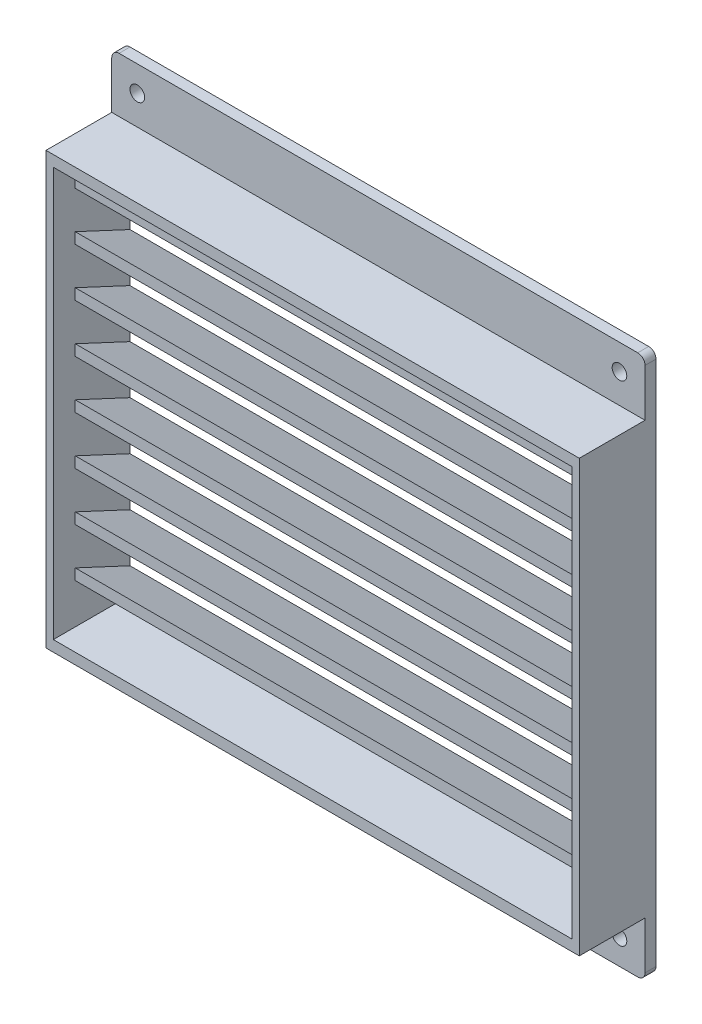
ISO-10303-21;
HEADER;
FILE_DESCRIPTION(('STEP AP214'),'2;1');
FILE_NAME('part.step','',(''),(''),'','','');
FILE_SCHEMA(('AUTOMOTIVE_DESIGN { 1 0 10303 214 1 1 1 1 }'));
ENDSEC;
DATA;
#1=APPLICATION_CONTEXT('core data for automotive mechanical design processes');
#2=APPLICATION_PROTOCOL_DEFINITION('international standard','automotive_design',2000,#1);
#3=PRODUCT_CONTEXT('',#1,'mechanical');
#4=PRODUCT('Part','Part','',(#3));
#5=PRODUCT_RELATED_PRODUCT_CATEGORY('part','',(#4));
#6=PRODUCT_DEFINITION_FORMATION('','',#4);
#7=PRODUCT_DEFINITION_CONTEXT('part definition',#1,'design');
#8=PRODUCT_DEFINITION('design','',#6,#7);
#9=PRODUCT_DEFINITION_SHAPE('','',#8);
#10=(LENGTH_UNIT() NAMED_UNIT(*) SI_UNIT(.MILLI.,.METRE.));
#11=(NAMED_UNIT(*) PLANE_ANGLE_UNIT() SI_UNIT($,.RADIAN.));
#12=(NAMED_UNIT(*) SI_UNIT($,.STERADIAN.) SOLID_ANGLE_UNIT());
#13=UNCERTAINTY_MEASURE_WITH_UNIT(LENGTH_MEASURE(1.E-05),#10,'distance_accuracy_value','');
#14=(GEOMETRIC_REPRESENTATION_CONTEXT(3) GLOBAL_UNCERTAINTY_ASSIGNED_CONTEXT((#13)) GLOBAL_UNIT_ASSIGNED_CONTEXT((#10,
#11,#12)) REPRESENTATION_CONTEXT('',''));
#15=CARTESIAN_POINT('',(0.,0.,0.));
#16=DIRECTION('',(0.,0.,1.));
#17=DIRECTION('',(1.,0.,0.));
#18=AXIS2_PLACEMENT_3D('',#15,#16,#17);
#19=CARTESIAN_POINT('',(146.,118.,139.016947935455));
#20=DIRECTION('',(0.,1.,0.));
#21=DIRECTION('',(0.,0.,1.));
#22=AXIS2_PLACEMENT_3D('',#19,#20,#21);
#23=PLANE('',#22);
#24=DIRECTION('',(0.,0.,-1.));
#25=VECTOR('',#24,1.);
#26=CARTESIAN_POINT('',(146.,118.,139.016947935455));
#27=LINE('',#26,#25);
#28=CARTESIAN_POINT('',(146.,118.,21.));
#29=VERTEX_POINT('',#28);
#30=CARTESIAN_POINT('',(146.,118.,3.));
#31=VERTEX_POINT('',#30);
#32=EDGE_CURVE('E345',#29,#31,#27,.T.);
#33=ORIENTED_EDGE('',*,*,#32,.T.);
#34=DIRECTION('',(-1.,0.,0.));
#35=VECTOR('',#34,1.);
#36=CARTESIAN_POINT('',(146.,118.,3.));
#37=LINE('',#36,#35);
#38=CARTESIAN_POINT('',(0.,118.,3.));
#39=VERTEX_POINT('',#38);
#40=EDGE_CURVE('E354',#31,#39,#37,.T.);
#41=ORIENTED_EDGE('',*,*,#40,.T.);
#42=DIRECTION('',(0.,0.,1.));
#43=VECTOR('',#42,1.);
#44=CARTESIAN_POINT('',(0.,118.,0.));
#45=LINE('',#44,#43);
#46=CARTESIAN_POINT('',(0.,118.,21.));
#47=VERTEX_POINT('',#46);
#48=EDGE_CURVE('E712',#39,#47,#45,.T.);
#49=ORIENTED_EDGE('',*,*,#48,.T.);
#50=DIRECTION('',(-1.,0.,0.));
#51=VECTOR('',#50,1.);
#52=CARTESIAN_POINT('',(146.,118.,21.));
#53=LINE('',#52,#51);
#54=EDGE_CURVE('E365',#29,#47,#53,.T.);
#55=ORIENTED_EDGE('',*,*,#54,.F.);
#56=EDGE_LOOP('',(#33,#41,#49,#55));
#57=FACE_BOUND('',#56,.T.);
#58=ADVANCED_FACE('F35',(#57),#23,.T.);
#59=CARTESIAN_POINT('',(144.,118.,139.016947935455));
#60=DIRECTION('',(-1.,0.,0.));
#61=DIRECTION('',(0.,-1.,0.));
#62=AXIS2_PLACEMENT_3D('',#59,#60,#61);
#63=PLANE('',#62);
#64=DIRECTION('',(0.,-1.,0.));
#65=VECTOR('',#64,1.);
#66=CARTESIAN_POINT('',(144.,118.,15.0000000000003));
#67=LINE('',#66,#65);
#68=CARTESIAN_POINT('',(144.,109.994614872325,15.0000000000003));
#69=VERTEX_POINT('',#68);
#70=CARTESIAN_POINT('',(144.,106.994614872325,15.0000000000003));
#71=VERTEX_POINT('',#70);
#72=EDGE_CURVE('E556',#69,#71,#67,.T.);
#73=ORIENTED_EDGE('',*,*,#72,.T.);
#74=DIRECTION('',(0.,-0.422618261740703,-0.906307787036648));
#75=VECTOR('',#74,1.);
#76=CARTESIAN_POINT('',(144.,156.461491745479,121.082059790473));
#77=LINE('',#76,#75);
#78=CARTESIAN_POINT('',(144.,100.,3.28199245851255E-13));
#79=VERTEX_POINT('',#78);
#80=EDGE_CURVE('E562',#71,#79,#77,.T.);
#81=ORIENTED_EDGE('',*,*,#80,.T.);
#82=DIRECTION('',(0.,1.,0.));
#83=VECTOR('',#82,1.);
#84=CARTESIAN_POINT('',(144.,118.,0.));
#85=LINE('',#84,#83);
#86=CARTESIAN_POINT('',(144.,89.7142857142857,2.78320941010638E-13));
#87=VERTEX_POINT('',#86);
#88=EDGE_CURVE('E960',#87,#79,#85,.T.);
#89=ORIENTED_EDGE('',*,*,#88,.F.);
#90=DIRECTION('',(0.,0.422618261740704,0.906307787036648));
#91=VECTOR('',#90,1.);
#92=CARTESIAN_POINT('',(144.,148.012869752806,125.021716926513));
#93=LINE('',#92,#91);
#94=CARTESIAN_POINT('',(144.,96.7089005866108,15.0000000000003));
#95=VERTEX_POINT('',#94);
#96=EDGE_CURVE('E580',#87,#95,#93,.T.);
#97=ORIENTED_EDGE('',*,*,#96,.T.);
#98=DIRECTION('',(0.,-1.,0.));
#99=VECTOR('',#98,1.);
#100=CARTESIAN_POINT('',(144.,118.,15.0000000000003));
#101=LINE('',#100,#99);
#102=CARTESIAN_POINT('',(144.,93.7089005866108,15.0000000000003));
#103=VERTEX_POINT('',#102);
#104=EDGE_CURVE('E577',#95,#103,#101,.T.);
#105=ORIENTED_EDGE('',*,*,#104,.T.);
#106=DIRECTION('',(0.,-0.422618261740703,-0.906307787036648));
#107=VECTOR('',#106,1.);
#108=CARTESIAN_POINT('',(144.,145.548688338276,126.170783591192));
#109=LINE('',#108,#107);
#110=CARTESIAN_POINT('',(144.,86.7142857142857,2.78320941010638E-13));
#111=VERTEX_POINT('',#110);
#112=EDGE_CURVE('E583',#103,#111,#109,.T.);
#113=ORIENTED_EDGE('',*,*,#112,.T.);
#114=CARTESIAN_POINT('',(144.,76.4285714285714,2.31934117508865E-13));
#115=VERTEX_POINT('',#114);
#116=EDGE_CURVE('E955',#115,#111,#85,.T.);
#117=ORIENTED_EDGE('',*,*,#116,.F.);
#118=DIRECTION('',(0.,0.422618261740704,0.906307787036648));
#119=VECTOR('',#118,1.);
#120=CARTESIAN_POINT('',(144.,137.100066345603,130.110440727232));
#121=LINE('',#120,#119);
#122=CARTESIAN_POINT('',(144.,83.4231863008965,15.0000000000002));
#123=VERTEX_POINT('',#122);
#124=EDGE_CURVE('E685',#115,#123,#121,.T.);
#125=ORIENTED_EDGE('',*,*,#124,.T.);
#126=DIRECTION('',(0.,-1.,0.));
#127=VECTOR('',#126,1.);
#128=CARTESIAN_POINT('',(144.,118.,15.0000000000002));
#129=LINE('',#128,#127);
#130=CARTESIAN_POINT('',(144.,80.4231863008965,15.0000000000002));
#131=VERTEX_POINT('',#130);
#132=EDGE_CURVE('E682',#123,#131,#129,.T.);
#133=ORIENTED_EDGE('',*,*,#132,.T.);
#134=DIRECTION('',(0.,-0.422618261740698,-0.906307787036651));
#135=VECTOR('',#134,1.);
#136=CARTESIAN_POINT('',(144.,134.635884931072,131.259507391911));
#137=LINE('',#136,#135);
#138=CARTESIAN_POINT('',(144.,73.4285714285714,0.));
#139=VERTEX_POINT('',#138);
#140=EDGE_CURVE('E688',#131,#139,#137,.T.);
#141=ORIENTED_EDGE('',*,*,#140,.T.);
#142=CARTESIAN_POINT('',(144.,63.1428571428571,1.85547294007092E-13));
#143=VERTEX_POINT('',#142);
#144=EDGE_CURVE('E959',#143,#139,#85,.T.);
#145=ORIENTED_EDGE('',*,*,#144,.F.);
#146=DIRECTION('',(0.,0.422618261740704,0.906307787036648));
#147=VECTOR('',#146,1.);
#148=CARTESIAN_POINT('',(144.,126.187262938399,135.199164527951));
#149=LINE('',#148,#147);
#150=CARTESIAN_POINT('',(144.,70.1374720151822,15.0000000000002));
#151=VERTEX_POINT('',#150);
#152=EDGE_CURVE('E601',#143,#151,#149,.T.);
#153=ORIENTED_EDGE('',*,*,#152,.T.);
#154=DIRECTION('',(0.,-1.,0.));
#155=VECTOR('',#154,1.);
#156=CARTESIAN_POINT('',(144.,118.,15.0000000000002));
#157=LINE('',#156,#155);
#158=CARTESIAN_POINT('',(144.,67.1374720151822,15.0000000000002));
#159=VERTEX_POINT('',#158);
#160=EDGE_CURVE('E598',#151,#159,#157,.T.);
#161=ORIENTED_EDGE('',*,*,#160,.T.);
#162=DIRECTION('',(0.,-0.422618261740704,-0.906307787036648));
#163=VECTOR('',#162,1.);
#164=CARTESIAN_POINT('',(144.,123.723081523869,136.34823119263));
#165=LINE('',#164,#163);
#166=CARTESIAN_POINT('',(144.,60.1428571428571,1.85547294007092E-13));
#167=VERTEX_POINT('',#166);
#168=EDGE_CURVE('E604',#159,#167,#165,.T.);
#169=ORIENTED_EDGE('',*,*,#168,.T.);
#170=CARTESIAN_POINT('',(144.,49.8571428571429,1.39160470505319E-13));
#171=VERTEX_POINT('',#170);
#172=EDGE_CURVE('E964',#171,#167,#85,.T.);
#173=ORIENTED_EDGE('',*,*,#172,.F.);
#174=DIRECTION('',(0.,0.422618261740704,0.906307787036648));
#175=VECTOR('',#174,1.);
#176=CARTESIAN_POINT('',(144.,115.274459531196,140.28788832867));
#177=LINE('',#176,#175);
#178=CARTESIAN_POINT('',(144.,56.8517577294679,15.0000000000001));
#179=VERTEX_POINT('',#178);
#180=EDGE_CURVE('E622',#171,#179,#177,.T.);
#181=ORIENTED_EDGE('',*,*,#180,.T.);
#182=DIRECTION('',(0.,-1.,0.));
#183=VECTOR('',#182,1.);
#184=CARTESIAN_POINT('',(144.,118.,15.0000000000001));
#185=LINE('',#184,#183);
#186=CARTESIAN_POINT('',(144.,53.8517577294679,15.0000000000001));
#187=VERTEX_POINT('',#186);
#188=EDGE_CURVE('E619',#179,#187,#185,.T.);
#189=ORIENTED_EDGE('',*,*,#188,.T.);
#190=DIRECTION('',(0.,-0.422618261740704,-0.906307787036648));
#191=VECTOR('',#190,1.);
#192=CARTESIAN_POINT('',(144.,112.810278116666,141.436954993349));
#193=LINE('',#192,#191);
#194=CARTESIAN_POINT('',(144.,46.8571428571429,1.39160470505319E-13));
#195=VERTEX_POINT('',#194);
#196=EDGE_CURVE('E625',#187,#195,#193,.T.);
#197=ORIENTED_EDGE('',*,*,#196,.T.);
#198=CARTESIAN_POINT('',(144.,36.5714285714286,0.));
#199=VERTEX_POINT('',#198);
#200=EDGE_CURVE('E957',#199,#195,#85,.T.);
#201=ORIENTED_EDGE('',*,*,#200,.F.);
#202=DIRECTION('',(0.,0.422618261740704,0.906307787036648));
#203=VECTOR('',#202,1.);
#204=CARTESIAN_POINT('',(144.,104.361656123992,145.376612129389));
#205=LINE('',#204,#203);
#206=CARTESIAN_POINT('',(144.,43.5660434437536,15.0000000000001));
#207=VERTEX_POINT('',#206);
#208=EDGE_CURVE('E643',#199,#207,#205,.T.);
#209=ORIENTED_EDGE('',*,*,#208,.T.);
#210=DIRECTION('',(0.,-1.,0.));
#211=VECTOR('',#210,1.);
#212=CARTESIAN_POINT('',(144.,118.,15.0000000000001));
#213=LINE('',#212,#211);
#214=CARTESIAN_POINT('',(144.,40.5660434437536,15.0000000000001));
#215=VERTEX_POINT('',#214);
#216=EDGE_CURVE('E640',#207,#215,#213,.T.);
#217=ORIENTED_EDGE('',*,*,#216,.T.);
#218=DIRECTION('',(0.,-0.422618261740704,-0.906307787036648));
#219=VECTOR('',#218,1.);
#220=CARTESIAN_POINT('',(144.,101.897474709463,146.525678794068));
#221=LINE('',#220,#219);
#222=CARTESIAN_POINT('',(144.,33.5714285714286,0.));
#223=VERTEX_POINT('',#222);
#224=EDGE_CURVE('E646',#215,#223,#221,.T.);
#225=ORIENTED_EDGE('',*,*,#224,.T.);
#226=CARTESIAN_POINT('',(144.,23.2857142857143,0.));
#227=VERTEX_POINT('',#226);
#228=EDGE_CURVE('E954',#227,#223,#85,.T.);
#229=ORIENTED_EDGE('',*,*,#228,.F.);
#230=DIRECTION('',(0.,0.422618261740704,0.906307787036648));
#231=VECTOR('',#230,1.);
#232=CARTESIAN_POINT('',(144.,93.448852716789,150.465335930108));
#233=LINE('',#232,#231);
#234=CARTESIAN_POINT('',(144.,30.2803291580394,15.));
#235=VERTEX_POINT('',#234);
#236=EDGE_CURVE('E664',#227,#235,#233,.T.);
#237=ORIENTED_EDGE('',*,*,#236,.T.);
#238=DIRECTION('',(0.,-1.,0.));
#239=VECTOR('',#238,1.);
#240=CARTESIAN_POINT('',(144.,118.,15.));
#241=LINE('',#240,#239);
#242=CARTESIAN_POINT('',(144.,27.2803291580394,15.));
#243=VERTEX_POINT('',#242);
#244=EDGE_CURVE('E661',#235,#243,#241,.T.);
#245=ORIENTED_EDGE('',*,*,#244,.T.);
#246=DIRECTION('',(0.,-0.422618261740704,-0.906307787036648));
#247=VECTOR('',#246,1.);
#248=CARTESIAN_POINT('',(144.,90.9846713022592,151.614402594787));
#249=LINE('',#248,#247);
#250=CARTESIAN_POINT('',(144.,20.2857142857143,0.));
#251=VERTEX_POINT('',#250);
#252=EDGE_CURVE('E667',#243,#251,#249,.T.);
#253=ORIENTED_EDGE('',*,*,#252,.T.);
#254=CARTESIAN_POINT('',(144.,10.,0.));
#255=VERTEX_POINT('',#254);
#256=EDGE_CURVE('E371',#255,#251,#85,.T.);
#257=ORIENTED_EDGE('',*,*,#256,.F.);
#258=DIRECTION('',(0.,0.422618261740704,0.906307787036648));
#259=VECTOR('',#258,1.);
#260=CARTESIAN_POINT('',(144.,82.5360493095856,155.554059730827));
#261=LINE('',#260,#259);
#262=CARTESIAN_POINT('',(144.,16.9946148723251,15.));
#263=VERTEX_POINT('',#262);
#264=EDGE_CURVE('E709',#255,#263,#261,.T.);
#265=ORIENTED_EDGE('',*,*,#264,.T.);
#266=DIRECTION('',(0.,-1.,0.));
#267=VECTOR('',#266,1.);
#268=CARTESIAN_POINT('',(144.,118.,14.9999999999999));
#269=LINE('',#268,#267);
#270=CARTESIAN_POINT('',(144.,13.9946148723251,15.));
#271=VERTEX_POINT('',#270);
#272=EDGE_CURVE('E706',#263,#271,#269,.T.);
#273=ORIENTED_EDGE('',*,*,#272,.T.);
#274=DIRECTION('',(0.,-0.422618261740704,-0.906307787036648));
#275=VECTOR('',#274,1.);
#276=CARTESIAN_POINT('',(144.,80.0718678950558,156.703126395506));
#277=LINE('',#276,#275);
#278=CARTESIAN_POINT('',(144.,7.00000000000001,0.));
#279=VERTEX_POINT('',#278);
#280=EDGE_CURVE('E703',#271,#279,#277,.T.);
#281=ORIENTED_EDGE('',*,*,#280,.T.);
#282=CARTESIAN_POINT('',(144.,3.,0.));
#283=VERTEX_POINT('',#282);
#284=EDGE_CURVE('E367',#283,#279,#85,.T.);
#285=ORIENTED_EDGE('',*,*,#284,.F.);
#286=DIRECTION('',(0.,0.,-1.));
#287=VECTOR('',#286,1.);
#288=CARTESIAN_POINT('',(144.,3.,0.));
#289=LINE('',#288,#287);
#290=CARTESIAN_POINT('',(144.,3.,21.));
#291=VERTEX_POINT('',#290);
#292=EDGE_CURVE('E376',#291,#283,#289,.T.);
#293=ORIENTED_EDGE('',*,*,#292,.F.);
#294=DIRECTION('',(0.,-1.,0.));
#295=VECTOR('',#294,1.);
#296=CARTESIAN_POINT('',(144.,118.,21.));
#297=LINE('',#296,#295);
#298=CARTESIAN_POINT('',(144.,115.,21.));
#299=VERTEX_POINT('',#298);
#300=EDGE_CURVE('E366',#299,#291,#297,.T.);
#301=ORIENTED_EDGE('',*,*,#300,.F.);
#302=DIRECTION('',(0.,0.,-1.));
#303=VECTOR('',#302,1.);
#304=CARTESIAN_POINT('',(144.,115.,139.016947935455));
#305=LINE('',#304,#303);
#306=CARTESIAN_POINT('',(144.,115.,0.));
#307=VERTEX_POINT('',#306);
#308=EDGE_CURVE('E403',#299,#307,#305,.T.);
#309=ORIENTED_EDGE('',*,*,#308,.T.);
#310=CARTESIAN_POINT('',(144.,103.,0.));
#311=VERTEX_POINT('',#310);
#312=EDGE_CURVE('E373',#311,#307,#85,.T.);
#313=ORIENTED_EDGE('',*,*,#312,.F.);
#314=DIRECTION('',(0.,0.422618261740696,0.906307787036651));
#315=VECTOR('',#314,1.);
#316=CARTESIAN_POINT('',(144.,158.925673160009,119.932993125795));
#317=LINE('',#316,#315);
#318=EDGE_CURVE('E559',#311,#69,#317,.T.);
#319=ORIENTED_EDGE('',*,*,#318,.T.);
#320=EDGE_LOOP('',(#73,#81,#89,#97,#105,#113,#117,#125,#133,#141,#145,#153,#161,#169,#173,#181,
#189,#197,#201,#209,#217,#225,#229,#237,#245,#253,#257,#265,#273,#281,#285,#293,#301,#309,#313,#319));
#321=FACE_BOUND('',#320,.T.);
#322=ADVANCED_FACE('F771',(#321),#63,.T.);
#323=CARTESIAN_POINT('',(146.,0.,0.));
#324=DIRECTION('',(0.,0.,1.));
#325=DIRECTION('',(1.,0.,0.));
#326=AXIS2_PLACEMENT_3D('',#323,#324,#325);
#327=PLANE('',#326);
#328=DIRECTION('',(0.,-1.,0.));
#329=VECTOR('',#328,1.);
#330=CARTESIAN_POINT('',(2.,118.,0.));
#331=LINE('',#330,#329);
#332=CARTESIAN_POINT('',(1.99999999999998,7.00000000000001,0.));
#333=VERTEX_POINT('',#332);
#334=CARTESIAN_POINT('',(1.99999999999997,3.,0.));
#335=VERTEX_POINT('',#334);
#336=EDGE_CURVE('E467',#333,#335,#331,.T.);
#337=ORIENTED_EDGE('',*,*,#336,.T.);
#338=DIRECTION('',(-1.,0.,0.));
#339=VECTOR('',#338,1.);
#340=CARTESIAN_POINT('',(146.,3.,0.));
#341=LINE('',#340,#339);
#342=EDGE_CURVE('E400',#283,#335,#341,.T.);
#343=ORIENTED_EDGE('',*,*,#342,.F.);
#344=ORIENTED_EDGE('',*,*,#284,.T.);
#345=DIRECTION('',(-1.,0.,0.));
#346=VECTOR('',#345,1.);
#347=CARTESIAN_POINT('',(146.,7.,0.));
#348=LINE('',#347,#346);
#349=EDGE_CURVE('E691',#279,#333,#348,.T.);
#350=ORIENTED_EDGE('',*,*,#349,.T.);
#351=EDGE_LOOP('',(#337,#343,#344,#350));
#352=FACE_BOUND('',#351,.T.);
#353=CARTESIAN_POINT('',(1.99999999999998,20.2857142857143,0.));
#354=VERTEX_POINT('',#353);
#355=CARTESIAN_POINT('',(1.99999999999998,10.,0.));
#356=VERTEX_POINT('',#355);
#357=EDGE_CURVE('E470',#354,#356,#331,.T.);
#358=ORIENTED_EDGE('',*,*,#357,.T.);
#359=DIRECTION('',(-1.,0.,0.));
#360=VECTOR('',#359,1.);
#361=CARTESIAN_POINT('',(146.,10.,0.));
#362=LINE('',#361,#360);
#363=EDGE_CURVE('E700',#255,#356,#362,.T.);
#364=ORIENTED_EDGE('',*,*,#363,.F.);
#365=ORIENTED_EDGE('',*,*,#256,.T.);
#366=DIRECTION('',(-1.,0.,0.));
#367=VECTOR('',#366,1.);
#368=CARTESIAN_POINT('',(146.,20.2857142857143,0.));
#369=LINE('',#368,#367);
#370=EDGE_CURVE('E658',#251,#354,#369,.T.);
#371=ORIENTED_EDGE('',*,*,#370,.T.);
#372=EDGE_LOOP('',(#358,#364,#365,#371));
#373=FACE_BOUND('',#372,.T.);
#374=CARTESIAN_POINT('',(1.99999999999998,33.5714285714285,0.));
#375=VERTEX_POINT('',#374);
#376=CARTESIAN_POINT('',(1.99999999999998,23.2857142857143,0.));
#377=VERTEX_POINT('',#376);
#378=EDGE_CURVE('E994',#375,#377,#331,.T.);
#379=ORIENTED_EDGE('',*,*,#378,.T.);
#380=DIRECTION('',(-1.,0.,0.));
#381=VECTOR('',#380,1.);
#382=CARTESIAN_POINT('',(146.,23.2857142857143,0.));
#383=LINE('',#382,#381);
#384=EDGE_CURVE('E655',#227,#377,#383,.T.);
#385=ORIENTED_EDGE('',*,*,#384,.F.);
#386=ORIENTED_EDGE('',*,*,#228,.T.);
#387=DIRECTION('',(-1.,0.,0.));
#388=VECTOR('',#387,1.);
#389=CARTESIAN_POINT('',(146.,33.5714285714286,0.));
#390=LINE('',#389,#388);
#391=EDGE_CURVE('E637',#223,#375,#390,.T.);
#392=ORIENTED_EDGE('',*,*,#391,.T.);
#393=EDGE_LOOP('',(#379,#385,#386,#392));
#394=FACE_BOUND('',#393,.T.);
#395=CARTESIAN_POINT('',(1.99999999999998,46.8571428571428,0.));
#396=VERTEX_POINT('',#395);
#397=CARTESIAN_POINT('',(1.99999999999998,36.5714285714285,0.));
#398=VERTEX_POINT('',#397);
#399=EDGE_CURVE('E990',#396,#398,#331,.T.);
#400=ORIENTED_EDGE('',*,*,#399,.T.);
#401=DIRECTION('',(-1.,0.,0.));
#402=VECTOR('',#401,1.);
#403=CARTESIAN_POINT('',(146.,36.5714285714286,0.));
#404=LINE('',#403,#402);
#405=EDGE_CURVE('E634',#199,#398,#404,.T.);
#406=ORIENTED_EDGE('',*,*,#405,.F.);
#407=ORIENTED_EDGE('',*,*,#200,.T.);
#408=DIRECTION('',(-1.,0.,0.));
#409=VECTOR('',#408,1.);
#410=CARTESIAN_POINT('',(146.,46.8571428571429,1.39160470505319E-13));
#411=LINE('',#410,#409);
#412=EDGE_CURVE('E616',#195,#396,#411,.T.);
#413=ORIENTED_EDGE('',*,*,#412,.T.);
#414=EDGE_LOOP('',(#400,#406,#407,#413));
#415=FACE_BOUND('',#414,.T.);
#416=CARTESIAN_POINT('',(1.99999999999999,60.1428571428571,0.));
#417=VERTEX_POINT('',#416);
#418=CARTESIAN_POINT('',(1.99999999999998,49.8571428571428,0.));
#419=VERTEX_POINT('',#418);
#420=EDGE_CURVE('E986',#417,#419,#331,.T.);
#421=ORIENTED_EDGE('',*,*,#420,.T.);
#422=DIRECTION('',(-1.,0.,0.));
#423=VECTOR('',#422,1.);
#424=CARTESIAN_POINT('',(146.,49.8571428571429,1.39160470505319E-13));
#425=LINE('',#424,#423);
#426=EDGE_CURVE('E613',#171,#419,#425,.T.);
#427=ORIENTED_EDGE('',*,*,#426,.F.);
#428=ORIENTED_EDGE('',*,*,#172,.T.);
#429=DIRECTION('',(-1.,0.,0.));
#430=VECTOR('',#429,1.);
#431=CARTESIAN_POINT('',(146.,60.1428571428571,1.85547294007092E-13));
#432=LINE('',#431,#430);
#433=EDGE_CURVE('E595',#167,#417,#432,.T.);
#434=ORIENTED_EDGE('',*,*,#433,.T.);
#435=EDGE_LOOP('',(#421,#427,#428,#434));
#436=FACE_BOUND('',#435,.T.);
#437=CARTESIAN_POINT('',(1.99999999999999,73.4285714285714,0.));
#438=VERTEX_POINT('',#437);
#439=CARTESIAN_POINT('',(1.99999999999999,63.1428571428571,0.));
#440=VERTEX_POINT('',#439);
#441=EDGE_CURVE('E984',#438,#440,#331,.T.);
#442=ORIENTED_EDGE('',*,*,#441,.T.);
#443=DIRECTION('',(-1.,0.,0.));
#444=VECTOR('',#443,1.);
#445=CARTESIAN_POINT('',(146.,63.1428571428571,1.85547294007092E-13));
#446=LINE('',#445,#444);
#447=EDGE_CURVE('E592',#143,#440,#446,.T.);
#448=ORIENTED_EDGE('',*,*,#447,.F.);
#449=ORIENTED_EDGE('',*,*,#144,.T.);
#450=DIRECTION('',(-1.,0.,0.));
#451=VECTOR('',#450,1.);
#452=CARTESIAN_POINT('',(146.,73.4285714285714,0.));
#453=LINE('',#452,#451);
#454=EDGE_CURVE('E679',#139,#438,#453,.T.);
#455=ORIENTED_EDGE('',*,*,#454,.T.);
#456=EDGE_LOOP('',(#442,#448,#449,#455));
#457=FACE_BOUND('',#456,.T.);
#458=CARTESIAN_POINT('',(1.99999999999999,86.7142857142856,0.));
#459=VERTEX_POINT('',#458);
#460=CARTESIAN_POINT('',(1.99999999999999,76.4285714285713,0.));
#461=VERTEX_POINT('',#460);
#462=EDGE_CURVE('E982',#459,#461,#331,.T.);
#463=ORIENTED_EDGE('',*,*,#462,.T.);
#464=DIRECTION('',(-1.,0.,0.));
#465=VECTOR('',#464,1.);
#466=CARTESIAN_POINT('',(146.,76.4285714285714,2.31934117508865E-13));
#467=LINE('',#466,#465);
#468=EDGE_CURVE('E676',#115,#461,#467,.T.);
#469=ORIENTED_EDGE('',*,*,#468,.F.);
#470=ORIENTED_EDGE('',*,*,#116,.T.);
#471=DIRECTION('',(-1.,0.,0.));
#472=VECTOR('',#471,1.);
#473=CARTESIAN_POINT('',(146.,86.7142857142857,2.78320941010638E-13));
#474=LINE('',#473,#472);
#475=EDGE_CURVE('E574',#111,#459,#474,.T.);
#476=ORIENTED_EDGE('',*,*,#475,.T.);
#477=EDGE_LOOP('',(#463,#469,#470,#476));
#478=FACE_BOUND('',#477,.T.);
#479=CARTESIAN_POINT('',(2.,99.9999999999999,0.));
#480=VERTEX_POINT('',#479);
#481=CARTESIAN_POINT('',(1.99999999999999,89.7142857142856,0.));
#482=VERTEX_POINT('',#481);
#483=EDGE_CURVE('E980',#480,#482,#331,.T.);
#484=ORIENTED_EDGE('',*,*,#483,.T.);
#485=DIRECTION('',(-1.,0.,0.));
#486=VECTOR('',#485,1.);
#487=CARTESIAN_POINT('',(146.,89.7142857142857,2.78320941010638E-13));
#488=LINE('',#487,#486);
#489=EDGE_CURVE('E571',#87,#482,#488,.T.);
#490=ORIENTED_EDGE('',*,*,#489,.F.);
#491=ORIENTED_EDGE('',*,*,#88,.T.);
#492=DIRECTION('',(-1.,0.,0.));
#493=VECTOR('',#492,1.);
#494=CARTESIAN_POINT('',(146.,100.,3.28199245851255E-13));
#495=LINE('',#494,#493);
#496=EDGE_CURVE('E553',#79,#480,#495,.T.);
#497=ORIENTED_EDGE('',*,*,#496,.T.);
#498=EDGE_LOOP('',(#484,#490,#491,#497));
#499=FACE_BOUND('',#498,.T.);
#500=CARTESIAN_POINT('',(2.,115.,0.));
#501=VERTEX_POINT('',#500);
#502=CARTESIAN_POINT('',(2.,103.,0.));
#503=VERTEX_POINT('',#502);
#504=EDGE_CURVE('E466',#501,#503,#331,.T.);
#505=ORIENTED_EDGE('',*,*,#504,.T.);
#506=DIRECTION('',(-1.,0.,0.));
#507=VECTOR('',#506,1.);
#508=CARTESIAN_POINT('',(146.,103.,0.));
#509=LINE('',#508,#507);
#510=EDGE_CURVE('E550',#311,#503,#509,.T.);
#511=ORIENTED_EDGE('',*,*,#510,.F.);
#512=ORIENTED_EDGE('',*,*,#312,.T.);
#513=DIRECTION('',(-1.,0.,0.));
#514=VECTOR('',#513,1.);
#515=CARTESIAN_POINT('',(146.,115.,0.));
#516=LINE('',#515,#514);
#517=EDGE_CURVE('E714',#307,#501,#516,.T.);
#518=ORIENTED_EDGE('',*,*,#517,.T.);
#519=EDGE_LOOP('',(#505,#511,#512,#518));
#520=FACE_BOUND('',#519,.T.);
#521=DIRECTION('',(0.,1.,0.));
#522=VECTOR('',#521,1.);
#523=CARTESIAN_POINT('',(0.,0.,0.));
#524=LINE('',#523,#522);
#525=CARTESIAN_POINT('',(0.,-13.,0.));
#526=VERTEX_POINT('',#525);
#527=CARTESIAN_POINT('',(0.,131.,0.));
#528=VERTEX_POINT('',#527);
#529=EDGE_CURVE('E379',#526,#528,#524,.T.);
#530=ORIENTED_EDGE('',*,*,#529,.T.);
#531=CARTESIAN_POINT('',(2.,131.,0.));
#532=DIRECTION('',(0.,0.,1.));
#533=DIRECTION('',(1.,0.,0.));
#534=AXIS2_PLACEMENT_3D('',#531,#532,#533);
#535=CIRCLE('',#534,2.);
#536=CARTESIAN_POINT('',(2.,133.,0.));
#537=VERTEX_POINT('',#536);
#538=EDGE_CURVE('E420',#528,#537,#535,.F.);
#539=ORIENTED_EDGE('',*,*,#538,.T.);
#540=DIRECTION('',(1.,0.,0.));
#541=VECTOR('',#540,1.);
#542=CARTESIAN_POINT('',(146.,133.,0.));
#543=LINE('',#542,#541);
#544=CARTESIAN_POINT('',(144.,133.,0.));
#545=VERTEX_POINT('',#544);
#546=EDGE_CURVE('E361',#537,#545,#543,.T.);
#547=ORIENTED_EDGE('',*,*,#546,.T.);
#548=CARTESIAN_POINT('',(144.,131.,0.));
#549=DIRECTION('',(0.,0.,1.));
#550=DIRECTION('',(1.,0.,0.));
#551=AXIS2_PLACEMENT_3D('',#548,#549,#550);
#552=CIRCLE('',#551,2.);
#553=CARTESIAN_POINT('',(146.,131.,0.));
#554=VERTEX_POINT('',#553);
#555=EDGE_CURVE('E414',#545,#554,#552,.F.);
#556=ORIENTED_EDGE('',*,*,#555,.T.);
#557=DIRECTION('',(0.,1.,0.));
#558=VECTOR('',#557,1.);
#559=CARTESIAN_POINT('',(146.,0.,0.));
#560=LINE('',#559,#558);
#561=CARTESIAN_POINT('',(146.,-13.,0.));
#562=VERTEX_POINT('',#561);
#563=EDGE_CURVE('E380',#562,#554,#560,.T.);
#564=ORIENTED_EDGE('',*,*,#563,.F.);
#565=CARTESIAN_POINT('',(144.,-13.,0.));
#566=DIRECTION('',(0.,0.,1.));
#567=DIRECTION('',(1.,0.,0.));
#568=AXIS2_PLACEMENT_3D('',#565,#566,#567);
#569=CIRCLE('',#568,2.);
#570=CARTESIAN_POINT('',(144.,-15.,0.));
#571=VERTEX_POINT('',#570);
#572=EDGE_CURVE('E416',#562,#571,#569,.F.);
#573=ORIENTED_EDGE('',*,*,#572,.T.);
#574=DIRECTION('',(-1.,0.,0.));
#575=VECTOR('',#574,1.);
#576=CARTESIAN_POINT('',(146.,-15.,0.));
#577=LINE('',#576,#575);
#578=CARTESIAN_POINT('',(2.,-15.,0.));
#579=VERTEX_POINT('',#578);
#580=EDGE_CURVE('E442',#571,#579,#577,.T.);
#581=ORIENTED_EDGE('',*,*,#580,.T.);
#582=CARTESIAN_POINT('',(2.,-13.,0.));
#583=DIRECTION('',(0.,0.,1.));
#584=DIRECTION('',(1.,0.,0.));
#585=AXIS2_PLACEMENT_3D('',#582,#583,#584);
#586=CIRCLE('',#585,2.);
#587=EDGE_CURVE('E418',#579,#526,#586,.F.);
#588=ORIENTED_EDGE('',*,*,#587,.T.);
#589=EDGE_LOOP('',(#530,#539,#547,#556,#564,#573,#581,#588));
#590=FACE_BOUND('',#589,.T.);
#591=CARTESIAN_POINT('',(7.00000000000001,-8.,0.));
#592=DIRECTION('',(0.,0.,-1.));
#593=DIRECTION('',(1.,0.,0.));
#594=AXIS2_PLACEMENT_3D('',#591,#592,#593);
#595=CIRCLE('',#594,2.);
#596=CARTESIAN_POINT('',(9.00000000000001,-8.,0.));
#597=VERTEX_POINT('',#596);
#598=EDGE_CURVE('E350',#597,#597,#595,.T.);
#599=ORIENTED_EDGE('',*,*,#598,.F.);
#600=EDGE_LOOP('',(#599));
#601=FACE_BOUND('',#600,.T.);
#602=CARTESIAN_POINT('',(139.,-8.,0.));
#603=DIRECTION('',(0.,0.,-1.));
#604=DIRECTION('',(-1.,0.,0.));
#605=AXIS2_PLACEMENT_3D('',#602,#603,#604);
#606=CIRCLE('',#605,2.);
#607=CARTESIAN_POINT('',(137.,-8.,0.));
#608=VERTEX_POINT('',#607);
#609=EDGE_CURVE('E456',#608,#608,#606,.T.);
#610=ORIENTED_EDGE('',*,*,#609,.F.);
#611=EDGE_LOOP('',(#610));
#612=FACE_BOUND('',#611,.T.);
#613=CARTESIAN_POINT('',(139.,126.,0.));
#614=DIRECTION('',(0.,0.,-1.));
#615=DIRECTION('',(1.,0.,0.));
#616=AXIS2_PLACEMENT_3D('',#613,#614,#615);
#617=CIRCLE('',#616,2.);
#618=CARTESIAN_POINT('',(141.,126.,0.));
#619=VERTEX_POINT('',#618);
#620=EDGE_CURVE('E752',#619,#619,#617,.T.);
#621=ORIENTED_EDGE('',*,*,#620,.F.);
#622=EDGE_LOOP('',(#621));
#623=FACE_BOUND('',#622,.T.);
#624=CARTESIAN_POINT('',(7.00000000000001,126.,0.));
#625=DIRECTION('',(0.,0.,-1.));
#626=DIRECTION('',(-1.,0.,0.));
#627=AXIS2_PLACEMENT_3D('',#624,#625,#626);
#628=CIRCLE('',#627,2.);
#629=CARTESIAN_POINT('',(5.00000000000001,126.,0.));
#630=VERTEX_POINT('',#629);
#631=EDGE_CURVE('E746',#630,#630,#628,.T.);
#632=ORIENTED_EDGE('',*,*,#631,.F.);
#633=EDGE_LOOP('',(#632));
#634=FACE_BOUND('',#633,.T.);
#635=ADVANCED_FACE('F447',(#352,#373,#394,#415,#436,#457,#478,#499,#520,#590,#601,#612,#623,
#634),#327,.F.);
#636=CARTESIAN_POINT('',(146.,3.,0.));
#637=DIRECTION('',(0.,-1.,0.));
#638=DIRECTION('',(0.,0.,-1.));
#639=AXIS2_PLACEMENT_3D('',#636,#637,#638);
#640=PLANE('',#639);
#641=ORIENTED_EDGE('',*,*,#342,.T.);
#642=DIRECTION('',(0.,0.,1.));
#643=VECTOR('',#642,1.);
#644=CARTESIAN_POINT('',(1.99999999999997,3.,0.));
#645=LINE('',#644,#643);
#646=CARTESIAN_POINT('',(1.99999999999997,3.,21.));
#647=VERTEX_POINT('',#646);
#648=EDGE_CURVE('E541',#335,#647,#645,.T.);
#649=ORIENTED_EDGE('',*,*,#648,.T.);
#650=DIRECTION('',(-1.,0.,0.));
#651=VECTOR('',#650,1.);
#652=CARTESIAN_POINT('',(146.,3.,21.));
#653=LINE('',#652,#651);
#654=EDGE_CURVE('E397',#291,#647,#653,.T.);
#655=ORIENTED_EDGE('',*,*,#654,.F.);
#656=ORIENTED_EDGE('',*,*,#292,.T.);
#657=EDGE_LOOP('',(#641,#649,#655,#656));
#658=FACE_BOUND('',#657,.T.);
#659=ADVANCED_FACE('F770',(#658),#640,.F.);
#660=CARTESIAN_POINT('',(146.,0.,21.));
#661=DIRECTION('',(0.,0.,-1.));
#662=DIRECTION('',(-1.,0.,0.));
#663=AXIS2_PLACEMENT_3D('',#660,#661,#662);
#664=PLANE('',#663);
#665=ORIENTED_EDGE('',*,*,#654,.T.);
#666=DIRECTION('',(0.,1.,0.));
#667=VECTOR('',#666,1.);
#668=CARTESIAN_POINT('',(2.,118.,21.));
#669=LINE('',#668,#667);
#670=CARTESIAN_POINT('',(2.,115.,21.));
#671=VERTEX_POINT('',#670);
#672=EDGE_CURVE('E462',#647,#671,#669,.T.);
#673=ORIENTED_EDGE('',*,*,#672,.T.);
#674=DIRECTION('',(-1.,0.,0.));
#675=VECTOR('',#674,1.);
#676=CARTESIAN_POINT('',(146.,115.,21.));
#677=LINE('',#676,#675);
#678=EDGE_CURVE('E717',#299,#671,#677,.T.);
#679=ORIENTED_EDGE('',*,*,#678,.F.);
#680=ORIENTED_EDGE('',*,*,#300,.T.);
#681=EDGE_LOOP('',(#665,#673,#679,#680));
#682=FACE_BOUND('',#681,.T.);
#683=ORIENTED_EDGE('',*,*,#54,.T.);
#684=DIRECTION('',(0.,-1.,0.));
#685=VECTOR('',#684,1.);
#686=CARTESIAN_POINT('',(0.,0.,21.));
#687=LINE('',#686,#685);
#688=CARTESIAN_POINT('',(0.,0.,21.));
#689=VERTEX_POINT('',#688);
#690=EDGE_CURVE('E391',#47,#689,#687,.T.);
#691=ORIENTED_EDGE('',*,*,#690,.T.);
#692=DIRECTION('',(-1.,0.,0.));
#693=VECTOR('',#692,1.);
#694=CARTESIAN_POINT('',(146.,0.,21.));
#695=LINE('',#694,#693);
#696=CARTESIAN_POINT('',(146.,0.,21.));
#697=VERTEX_POINT('',#696);
#698=EDGE_CURVE('E388',#697,#689,#695,.T.);
#699=ORIENTED_EDGE('',*,*,#698,.F.);
#700=DIRECTION('',(0.,-1.,0.));
#701=VECTOR('',#700,1.);
#702=CARTESIAN_POINT('',(146.,0.,21.));
#703=LINE('',#702,#701);
#704=EDGE_CURVE('E382',#29,#697,#703,.T.);
#705=ORIENTED_EDGE('',*,*,#704,.F.);
#706=EDGE_LOOP('',(#683,#691,#699,#705));
#707=FACE_BOUND('',#706,.T.);
#708=ADVANCED_FACE('F719',(#682,#707),#664,.F.);
#709=CARTESIAN_POINT('',(146.,0.,0.));
#710=DIRECTION('',(0.,1.,0.));
#711=DIRECTION('',(0.,0.,1.));
#712=AXIS2_PLACEMENT_3D('',#709,#710,#711);
#713=PLANE('',#712);
#714=DIRECTION('',(0.,0.,-1.));
#715=VECTOR('',#714,1.);
#716=CARTESIAN_POINT('',(0.,0.,0.));
#717=LINE('',#716,#715);
#718=CARTESIAN_POINT('',(0.,0.,3.));
#719=VERTEX_POINT('',#718);
#720=EDGE_CURVE('E383',#689,#719,#717,.T.);
#721=ORIENTED_EDGE('',*,*,#720,.T.);
#722=DIRECTION('',(1.,0.,0.));
#723=VECTOR('',#722,1.);
#724=CARTESIAN_POINT('',(146.,0.,3.));
#725=LINE('',#724,#723);
#726=CARTESIAN_POINT('',(146.,0.,3.));
#727=VERTEX_POINT('',#726);
#728=EDGE_CURVE('E460',#719,#727,#725,.T.);
#729=ORIENTED_EDGE('',*,*,#728,.T.);
#730=DIRECTION('',(0.,0.,-1.));
#731=VECTOR('',#730,1.);
#732=CARTESIAN_POINT('',(146.,0.,0.));
#733=LINE('',#732,#731);
#734=EDGE_CURVE('E385',#697,#727,#733,.T.);
#735=ORIENTED_EDGE('',*,*,#734,.F.);
#736=ORIENTED_EDGE('',*,*,#698,.T.);
#737=EDGE_LOOP('',(#721,#729,#735,#736));
#738=FACE_BOUND('',#737,.T.);
#739=ADVANCED_FACE('F727',(#738),#713,.F.);
#740=CARTESIAN_POINT('',(146.,0.,0.));
#741=DIRECTION('',(1.,0.,0.));
#742=DIRECTION('',(0.,0.,-1.));
#743=AXIS2_PLACEMENT_3D('',#740,#741,#742);
#744=PLANE('',#743);
#745=DIRECTION('',(0.,-1.,0.));
#746=VECTOR('',#745,1.);
#747=CARTESIAN_POINT('',(146.,0.,3.));
#748=LINE('',#747,#746);
#749=CARTESIAN_POINT('',(146.,-13.,3.));
#750=VERTEX_POINT('',#749);
#751=EDGE_CURVE('E451',#727,#750,#748,.T.);
#752=ORIENTED_EDGE('',*,*,#751,.T.);
#753=DIRECTION('',(0.,0.,-1.));
#754=VECTOR('',#753,1.);
#755=CARTESIAN_POINT('',(146.,-13.,0.));
#756=LINE('',#755,#754);
#757=EDGE_CURVE('E11',#750,#562,#756,.T.);
#758=ORIENTED_EDGE('',*,*,#757,.T.);
#759=ORIENTED_EDGE('',*,*,#563,.T.);
#760=DIRECTION('',(0.,0.,-1.));
#761=VECTOR('',#760,1.);
#762=CARTESIAN_POINT('',(146.,131.,0.));
#763=LINE('',#762,#761);
#764=CARTESIAN_POINT('',(146.,131.,3.));
#765=VERTEX_POINT('',#764);
#766=EDGE_CURVE('E43',#554,#765,#763,.F.);
#767=ORIENTED_EDGE('',*,*,#766,.T.);
#768=DIRECTION('',(0.,-1.,0.));
#769=VECTOR('',#768,1.);
#770=CARTESIAN_POINT('',(146.,118.,3.));
#771=LINE('',#770,#769);
#772=EDGE_CURVE('E341',#765,#31,#771,.T.);
#773=ORIENTED_EDGE('',*,*,#772,.T.);
#774=ORIENTED_EDGE('',*,*,#32,.F.);
#775=ORIENTED_EDGE('',*,*,#704,.T.);
#776=ORIENTED_EDGE('',*,*,#734,.T.);
#777=EDGE_LOOP('',(#752,#758,#759,#767,#773,#774,#775,#776));
#778=FACE_BOUND('',#777,.T.);
#779=ADVANCED_FACE('F343',(#778),#744,.T.);
#780=CARTESIAN_POINT('',(0.,0.,0.));
#781=DIRECTION('',(1.,0.,0.));
#782=DIRECTION('',(0.,0.,-1.));
#783=AXIS2_PLACEMENT_3D('',#780,#781,#782);
#784=PLANE('',#783);
#785=DIRECTION('',(0.,1.,0.));
#786=VECTOR('',#785,1.);
#787=CARTESIAN_POINT('',(0.,118.,3.));
#788=LINE('',#787,#786);
#789=CARTESIAN_POINT('',(0.,131.,3.));
#790=VERTEX_POINT('',#789);
#791=EDGE_CURVE('E358',#39,#790,#788,.T.);
#792=ORIENTED_EDGE('',*,*,#791,.T.);
#793=DIRECTION('',(0.,0.,-1.));
#794=VECTOR('',#793,1.);
#795=CARTESIAN_POINT('',(0.,131.,0.));
#796=LINE('',#795,#794);
#797=EDGE_CURVE('E411',#790,#528,#796,.T.);
#798=ORIENTED_EDGE('',*,*,#797,.T.);
#799=ORIENTED_EDGE('',*,*,#529,.F.);
#800=DIRECTION('',(0.,0.,-1.));
#801=VECTOR('',#800,1.);
#802=CARTESIAN_POINT('',(0.,-13.,3.));
#803=LINE('',#802,#801);
#804=CARTESIAN_POINT('',(0.,-13.,3.));
#805=VERTEX_POINT('',#804);
#806=EDGE_CURVE('E409',#526,#805,#803,.F.);
#807=ORIENTED_EDGE('',*,*,#806,.T.);
#808=DIRECTION('',(0.,1.,0.));
#809=VECTOR('',#808,1.);
#810=CARTESIAN_POINT('',(0.,0.,3.));
#811=LINE('',#810,#809);
#812=EDGE_CURVE('E729',#805,#719,#811,.T.);
#813=ORIENTED_EDGE('',*,*,#812,.T.);
#814=ORIENTED_EDGE('',*,*,#720,.F.);
#815=ORIENTED_EDGE('',*,*,#690,.F.);
#816=ORIENTED_EDGE('',*,*,#48,.F.);
#817=EDGE_LOOP('',(#792,#798,#799,#807,#813,#814,#815,#816));
#818=FACE_BOUND('',#817,.T.);
#819=ADVANCED_FACE('F798',(#818),#784,.F.);
#820=CARTESIAN_POINT('',(146.,115.,0.));
#821=DIRECTION('',(0.,1.,0.));
#822=DIRECTION('',(0.,0.,1.));
#823=AXIS2_PLACEMENT_3D('',#820,#821,#822);
#824=PLANE('',#823);
#825=ORIENTED_EDGE('',*,*,#678,.T.);
#826=DIRECTION('',(0.,0.,-1.));
#827=VECTOR('',#826,1.);
#828=CARTESIAN_POINT('',(2.,115.,0.));
#829=LINE('',#828,#827);
#830=EDGE_CURVE('E539',#671,#501,#829,.T.);
#831=ORIENTED_EDGE('',*,*,#830,.T.);
#832=ORIENTED_EDGE('',*,*,#517,.F.);
#833=ORIENTED_EDGE('',*,*,#308,.F.);
#834=EDGE_LOOP('',(#825,#831,#832,#833));
#835=FACE_BOUND('',#834,.T.);
#836=ADVANCED_FACE('F793',(#835),#824,.F.);
#837=CARTESIAN_POINT('',(146.,16.9946148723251,15.));
#838=DIRECTION('',(0.,-0.906307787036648,0.422618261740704));
#839=DIRECTION('',(0.,-0.422618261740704,-0.906307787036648));
#840=AXIS2_PLACEMENT_3D('',#837,#838,#839);
#841=PLANE('',#840);
#842=ORIENTED_EDGE('',*,*,#363,.T.);
#843=DIRECTION('',(0.,0.422618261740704,0.906307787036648));
#844=VECTOR('',#843,1.);
#845=CARTESIAN_POINT('',(1.99999999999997,16.9946148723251,15.));
#846=LINE('',#845,#844);
#847=CARTESIAN_POINT('',(1.99999999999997,16.9946148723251,15.));
#848=VERTEX_POINT('',#847);
#849=EDGE_CURVE('E536',#356,#848,#846,.T.);
#850=ORIENTED_EDGE('',*,*,#849,.T.);
#851=DIRECTION('',(-1.,0.,0.));
#852=VECTOR('',#851,1.);
#853=CARTESIAN_POINT('',(146.,16.9946148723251,15.));
#854=LINE('',#853,#852);
#855=EDGE_CURVE('E697',#263,#848,#854,.T.);
#856=ORIENTED_EDGE('',*,*,#855,.F.);
#857=ORIENTED_EDGE('',*,*,#264,.F.);
#858=EDGE_LOOP('',(#842,#850,#856,#857));
#859=FACE_BOUND('',#858,.T.);
#860=ADVANCED_FACE('F938',(#859),#841,.F.);
#861=CARTESIAN_POINT('',(146.,13.9946148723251,15.));
#862=DIRECTION('',(0.,0.,-1.));
#863=DIRECTION('',(0.,1.,0.));
#864=AXIS2_PLACEMENT_3D('',#861,#862,#863);
#865=PLANE('',#864);
#866=ORIENTED_EDGE('',*,*,#855,.T.);
#867=DIRECTION('',(0.,-1.,0.));
#868=VECTOR('',#867,1.);
#869=CARTESIAN_POINT('',(1.99999999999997,13.9946148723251,15.));
#870=LINE('',#869,#868);
#871=CARTESIAN_POINT('',(1.99999999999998,13.9946148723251,15.));
#872=VERTEX_POINT('',#871);
#873=EDGE_CURVE('E533',#848,#872,#870,.T.);
#874=ORIENTED_EDGE('',*,*,#873,.T.);
#875=DIRECTION('',(-1.,0.,0.));
#876=VECTOR('',#875,1.);
#877=CARTESIAN_POINT('',(146.,13.9946148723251,15.));
#878=LINE('',#877,#876);
#879=EDGE_CURVE('E694',#271,#872,#878,.T.);
#880=ORIENTED_EDGE('',*,*,#879,.F.);
#881=ORIENTED_EDGE('',*,*,#272,.F.);
#882=EDGE_LOOP('',(#866,#874,#880,#881));
#883=FACE_BOUND('',#882,.T.);
#884=ADVANCED_FACE('F935',(#883),#865,.F.);
#885=CARTESIAN_POINT('',(146.,7.,0.));
#886=DIRECTION('',(0.,0.906307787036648,-0.422618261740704));
#887=DIRECTION('',(0.,0.422618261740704,0.906307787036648));
#888=AXIS2_PLACEMENT_3D('',#885,#886,#887);
#889=PLANE('',#888);
#890=ORIENTED_EDGE('',*,*,#879,.T.);
#891=DIRECTION('',(0.,-0.422618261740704,-0.906307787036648));
#892=VECTOR('',#891,1.);
#893=CARTESIAN_POINT('',(1.99999999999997,7.00000000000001,0.));
#894=LINE('',#893,#892);
#895=EDGE_CURVE('E530',#872,#333,#894,.T.);
#896=ORIENTED_EDGE('',*,*,#895,.T.);
#897=ORIENTED_EDGE('',*,*,#349,.F.);
#898=ORIENTED_EDGE('',*,*,#280,.F.);
#899=EDGE_LOOP('',(#890,#896,#897,#898));
#900=FACE_BOUND('',#899,.T.);
#901=ADVANCED_FACE('F931',(#900),#889,.F.);
#902=CARTESIAN_POINT('',(146.,73.4285714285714,0.));
#903=DIRECTION('',(0.,0.90630778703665,-0.422618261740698));
#904=DIRECTION('',(0.,0.422618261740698,0.906307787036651));
#905=AXIS2_PLACEMENT_3D('',#902,#903,#904);
#906=PLANE('',#905);
#907=DIRECTION('',(-1.,0.,0.));
#908=VECTOR('',#907,1.);
#909=CARTESIAN_POINT('',(146.,80.4231863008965,15.0000000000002));
#910=LINE('',#909,#908);
#911=CARTESIAN_POINT('',(2.,80.4231863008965,15.0000000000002));
#912=VERTEX_POINT('',#911);
#913=EDGE_CURVE('E670',#131,#912,#910,.T.);
#914=ORIENTED_EDGE('',*,*,#913,.T.);
#915=DIRECTION('',(0.,-0.422618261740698,-0.906307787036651));
#916=VECTOR('',#915,1.);
#917=CARTESIAN_POINT('',(2.,73.4285714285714,0.));
#918=LINE('',#917,#916);
#919=EDGE_CURVE('E527',#912,#438,#918,.T.);
#920=ORIENTED_EDGE('',*,*,#919,.T.);
#921=ORIENTED_EDGE('',*,*,#454,.F.);
#922=ORIENTED_EDGE('',*,*,#140,.F.);
#923=EDGE_LOOP('',(#914,#920,#921,#922));
#924=FACE_BOUND('',#923,.T.);
#925=ADVANCED_FACE('F927',(#924),#906,.F.);
#926=CARTESIAN_POINT('',(146.,83.4231863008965,15.0000000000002));
#927=DIRECTION('',(0.,-0.906307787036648,0.422618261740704));
#928=DIRECTION('',(0.,-0.422618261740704,-0.906307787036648));
#929=AXIS2_PLACEMENT_3D('',#926,#927,#928);
#930=PLANE('',#929);
#931=ORIENTED_EDGE('',*,*,#468,.T.);
#932=DIRECTION('',(0.,0.422618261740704,0.906307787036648));
#933=VECTOR('',#932,1.);
#934=CARTESIAN_POINT('',(2.,83.4231863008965,15.0000000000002));
#935=LINE('',#934,#933);
#936=CARTESIAN_POINT('',(2.,83.4231863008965,15.0000000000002));
#937=VERTEX_POINT('',#936);
#938=EDGE_CURVE('E524',#461,#937,#935,.T.);
#939=ORIENTED_EDGE('',*,*,#938,.T.);
#940=DIRECTION('',(-1.,0.,0.));
#941=VECTOR('',#940,1.);
#942=CARTESIAN_POINT('',(146.,83.4231863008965,15.0000000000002));
#943=LINE('',#942,#941);
#944=EDGE_CURVE('E673',#123,#937,#943,.T.);
#945=ORIENTED_EDGE('',*,*,#944,.F.);
#946=ORIENTED_EDGE('',*,*,#124,.F.);
#947=EDGE_LOOP('',(#931,#939,#945,#946));
#948=FACE_BOUND('',#947,.T.);
#949=ADVANCED_FACE('F923',(#948),#930,.F.);
#950=CARTESIAN_POINT('',(146.,80.4231863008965,15.0000000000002));
#951=DIRECTION('',(0.,0.,-1.));
#952=DIRECTION('',(0.,1.,0.));
#953=AXIS2_PLACEMENT_3D('',#950,#951,#952);
#954=PLANE('',#953);
#955=ORIENTED_EDGE('',*,*,#944,.T.);
#956=DIRECTION('',(0.,-1.,0.));
#957=VECTOR('',#956,1.);
#958=CARTESIAN_POINT('',(2.,80.4231863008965,15.0000000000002));
#959=LINE('',#958,#957);
#960=EDGE_CURVE('E521',#937,#912,#959,.T.);
#961=ORIENTED_EDGE('',*,*,#960,.T.);
#962=ORIENTED_EDGE('',*,*,#913,.F.);
#963=ORIENTED_EDGE('',*,*,#132,.F.);
#964=EDGE_LOOP('',(#955,#961,#962,#963));
#965=FACE_BOUND('',#964,.T.);
#966=ADVANCED_FACE('F919',(#965),#954,.F.);
#967=CARTESIAN_POINT('',(146.,20.2857142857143,0.));
#968=DIRECTION('',(0.,0.906307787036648,-0.422618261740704));
#969=DIRECTION('',(0.,0.422618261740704,0.906307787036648));
#970=AXIS2_PLACEMENT_3D('',#967,#968,#969);
#971=PLANE('',#970);
#972=DIRECTION('',(-1.,0.,0.));
#973=VECTOR('',#972,1.);
#974=CARTESIAN_POINT('',(146.,27.2803291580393,15.));
#975=LINE('',#974,#973);
#976=CARTESIAN_POINT('',(1.99999999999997,27.2803291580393,15.));
#977=VERTEX_POINT('',#976);
#978=EDGE_CURVE('E649',#243,#977,#975,.T.);
#979=ORIENTED_EDGE('',*,*,#978,.T.);
#980=DIRECTION('',(0.,-0.422618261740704,-0.906307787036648));
#981=VECTOR('',#980,1.);
#982=CARTESIAN_POINT('',(1.99999999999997,20.2857142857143,0.));
#983=LINE('',#982,#981);
#984=EDGE_CURVE('E518',#977,#354,#983,.T.);
#985=ORIENTED_EDGE('',*,*,#984,.T.);
#986=ORIENTED_EDGE('',*,*,#370,.F.);
#987=ORIENTED_EDGE('',*,*,#252,.F.);
#988=EDGE_LOOP('',(#979,#985,#986,#987));
#989=FACE_BOUND('',#988,.T.);
#990=ADVANCED_FACE('F915',(#989),#971,.F.);
#991=CARTESIAN_POINT('',(146.,30.2803291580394,15.));
#992=DIRECTION('',(0.,-0.906307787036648,0.422618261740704));
#993=DIRECTION('',(0.,-0.422618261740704,-0.906307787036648));
#994=AXIS2_PLACEMENT_3D('',#991,#992,#993);
#995=PLANE('',#994);
#996=ORIENTED_EDGE('',*,*,#384,.T.);
#997=DIRECTION('',(0.,0.422618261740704,0.906307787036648));
#998=VECTOR('',#997,1.);
#999=CARTESIAN_POINT('',(1.99999999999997,30.2803291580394,15.0000000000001));
#1000=LINE('',#999,#998);
#1001=CARTESIAN_POINT('',(1.99999999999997,30.2803291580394,15.));
#1002=VERTEX_POINT('',#1001);
#1003=EDGE_CURVE('E515',#377,#1002,#1000,.T.);
#1004=ORIENTED_EDGE('',*,*,#1003,.T.);
#1005=DIRECTION('',(-1.,0.,0.));
#1006=VECTOR('',#1005,1.);
#1007=CARTESIAN_POINT('',(146.,30.2803291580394,15.));
#1008=LINE('',#1007,#1006);
#1009=EDGE_CURVE('E652',#235,#1002,#1008,.T.);
#1010=ORIENTED_EDGE('',*,*,#1009,.F.);
#1011=ORIENTED_EDGE('',*,*,#236,.F.);
#1012=EDGE_LOOP('',(#996,#1004,#1010,#1011));
#1013=FACE_BOUND('',#1012,.T.);
#1014=ADVANCED_FACE('F911',(#1013),#995,.F.);
#1015=CARTESIAN_POINT('',(146.,27.2803291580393,15.));
#1016=DIRECTION('',(0.,0.,-1.));
#1017=DIRECTION('',(0.,1.,0.));
#1018=AXIS2_PLACEMENT_3D('',#1015,#1016,#1017);
#1019=PLANE('',#1018);
#1020=ORIENTED_EDGE('',*,*,#1009,.T.);
#1021=DIRECTION('',(0.,-1.,0.));
#1022=VECTOR('',#1021,1.);
#1023=CARTESIAN_POINT('',(1.99999999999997,27.2803291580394,15.));
#1024=LINE('',#1023,#1022);
#1025=EDGE_CURVE('E512',#1002,#977,#1024,.T.);
#1026=ORIENTED_EDGE('',*,*,#1025,.T.);
#1027=ORIENTED_EDGE('',*,*,#978,.F.);
#1028=ORIENTED_EDGE('',*,*,#244,.F.);
#1029=EDGE_LOOP('',(#1020,#1026,#1027,#1028));
#1030=FACE_BOUND('',#1029,.T.);
#1031=ADVANCED_FACE('F907',(#1030),#1019,.F.);
#1032=CARTESIAN_POINT('',(146.,33.5714285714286,0.));
#1033=DIRECTION('',(0.,0.906307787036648,-0.422618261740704));
#1034=DIRECTION('',(0.,0.422618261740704,0.906307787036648));
#1035=AXIS2_PLACEMENT_3D('',#1032,#1033,#1034);
#1036=PLANE('',#1035);
#1037=DIRECTION('',(-1.,0.,0.));
#1038=VECTOR('',#1037,1.);
#1039=CARTESIAN_POINT('',(146.,40.5660434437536,15.0000000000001));
#1040=LINE('',#1039,#1038);
#1041=CARTESIAN_POINT('',(1.99999999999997,40.5660434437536,15.0000000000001));
#1042=VERTEX_POINT('',#1041);
#1043=EDGE_CURVE('E628',#215,#1042,#1040,.T.);
#1044=ORIENTED_EDGE('',*,*,#1043,.T.);
#1045=DIRECTION('',(0.,-0.422618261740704,-0.906307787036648));
#1046=VECTOR('',#1045,1.);
#1047=CARTESIAN_POINT('',(1.99999999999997,33.5714285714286,1.04936234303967E-13));
#1048=LINE('',#1047,#1046);
#1049=EDGE_CURVE('E509',#1042,#375,#1048,.T.);
#1050=ORIENTED_EDGE('',*,*,#1049,.T.);
#1051=ORIENTED_EDGE('',*,*,#391,.F.);
#1052=ORIENTED_EDGE('',*,*,#224,.F.);
#1053=EDGE_LOOP('',(#1044,#1050,#1051,#1052));
#1054=FACE_BOUND('',#1053,.T.);
#1055=ADVANCED_FACE('F903',(#1054),#1036,.F.);
#1056=CARTESIAN_POINT('',(146.,43.5660434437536,15.0000000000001));
#1057=DIRECTION('',(0.,-0.906307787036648,0.422618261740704));
#1058=DIRECTION('',(0.,-0.422618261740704,-0.906307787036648));
#1059=AXIS2_PLACEMENT_3D('',#1056,#1057,#1058);
#1060=PLANE('',#1059);
#1061=ORIENTED_EDGE('',*,*,#405,.T.);
#1062=DIRECTION('',(0.,0.422618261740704,0.906307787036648));
#1063=VECTOR('',#1062,1.);
#1064=CARTESIAN_POINT('',(1.99999999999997,43.5660434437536,15.0000000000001));
#1065=LINE('',#1064,#1063);
#1066=CARTESIAN_POINT('',(1.99999999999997,43.5660434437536,15.0000000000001));
#1067=VERTEX_POINT('',#1066);
#1068=EDGE_CURVE('E506',#398,#1067,#1065,.T.);
#1069=ORIENTED_EDGE('',*,*,#1068,.T.);
#1070=DIRECTION('',(-1.,0.,0.));
#1071=VECTOR('',#1070,1.);
#1072=CARTESIAN_POINT('',(146.,43.5660434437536,15.0000000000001));
#1073=LINE('',#1072,#1071);
#1074=EDGE_CURVE('E631',#207,#1067,#1073,.T.);
#1075=ORIENTED_EDGE('',*,*,#1074,.F.);
#1076=ORIENTED_EDGE('',*,*,#208,.F.);
#1077=EDGE_LOOP('',(#1061,#1069,#1075,#1076));
#1078=FACE_BOUND('',#1077,.T.);
#1079=ADVANCED_FACE('F899',(#1078),#1060,.F.);
#1080=CARTESIAN_POINT('',(146.,40.5660434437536,15.0000000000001));
#1081=DIRECTION('',(0.,0.,-1.));
#1082=DIRECTION('',(0.,1.,0.));
#1083=AXIS2_PLACEMENT_3D('',#1080,#1081,#1082);
#1084=PLANE('',#1083);
#1085=ORIENTED_EDGE('',*,*,#1074,.T.);
#1086=DIRECTION('',(0.,-1.,0.));
#1087=VECTOR('',#1086,1.);
#1088=CARTESIAN_POINT('',(1.99999999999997,40.5660434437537,15.0000000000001));
#1089=LINE('',#1088,#1087);
#1090=EDGE_CURVE('E503',#1067,#1042,#1089,.T.);
#1091=ORIENTED_EDGE('',*,*,#1090,.T.);
#1092=ORIENTED_EDGE('',*,*,#1043,.F.);
#1093=ORIENTED_EDGE('',*,*,#216,.F.);
#1094=EDGE_LOOP('',(#1085,#1091,#1092,#1093));
#1095=FACE_BOUND('',#1094,.T.);
#1096=ADVANCED_FACE('F895',(#1095),#1084,.F.);
#1097=CARTESIAN_POINT('',(146.,46.8571428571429,1.39160470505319E-13));
#1098=DIRECTION('',(0.,0.906307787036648,-0.422618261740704));
#1099=DIRECTION('',(0.,0.422618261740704,0.906307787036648));
#1100=AXIS2_PLACEMENT_3D('',#1097,#1098,#1099);
#1101=PLANE('',#1100);
#1102=DIRECTION('',(-1.,0.,0.));
#1103=VECTOR('',#1102,1.);
#1104=CARTESIAN_POINT('',(146.,53.8517577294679,15.0000000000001));
#1105=LINE('',#1104,#1103);
#1106=CARTESIAN_POINT('',(1.99999999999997,53.8517577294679,15.0000000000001));
#1107=VERTEX_POINT('',#1106);
#1108=EDGE_CURVE('E607',#187,#1107,#1105,.T.);
#1109=ORIENTED_EDGE('',*,*,#1108,.T.);
#1110=DIRECTION('',(0.,-0.422618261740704,-0.906307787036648));
#1111=VECTOR('',#1110,1.);
#1112=CARTESIAN_POINT('',(1.99999999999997,46.8571428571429,1.5132305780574E-13));
#1113=LINE('',#1112,#1111);
#1114=EDGE_CURVE('E500',#1107,#396,#1113,.T.);
#1115=ORIENTED_EDGE('',*,*,#1114,.T.);
#1116=ORIENTED_EDGE('',*,*,#412,.F.);
#1117=ORIENTED_EDGE('',*,*,#196,.F.);
#1118=EDGE_LOOP('',(#1109,#1115,#1116,#1117));
#1119=FACE_BOUND('',#1118,.T.);
#1120=ADVANCED_FACE('F891',(#1119),#1101,.F.);
#1121=CARTESIAN_POINT('',(146.,56.8517577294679,15.0000000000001));
#1122=DIRECTION('',(0.,-0.906307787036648,0.422618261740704));
#1123=DIRECTION('',(0.,-0.422618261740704,-0.906307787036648));
#1124=AXIS2_PLACEMENT_3D('',#1121,#1122,#1123);
#1125=PLANE('',#1124);
#1126=ORIENTED_EDGE('',*,*,#426,.T.);
#1127=DIRECTION('',(0.,0.422618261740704,0.906307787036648));
#1128=VECTOR('',#1127,1.);
#1129=CARTESIAN_POINT('',(2.,56.8517577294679,15.0000000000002));
#1130=LINE('',#1129,#1128);
#1131=CARTESIAN_POINT('',(1.99999999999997,56.8517577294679,15.0000000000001));
#1132=VERTEX_POINT('',#1131);
#1133=EDGE_CURVE('E497',#419,#1132,#1130,.T.);
#1134=ORIENTED_EDGE('',*,*,#1133,.T.);
#1135=DIRECTION('',(-1.,0.,0.));
#1136=VECTOR('',#1135,1.);
#1137=CARTESIAN_POINT('',(146.,56.8517577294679,15.0000000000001));
#1138=LINE('',#1137,#1136);
#1139=EDGE_CURVE('E610',#179,#1132,#1138,.T.);
#1140=ORIENTED_EDGE('',*,*,#1139,.F.);
#1141=ORIENTED_EDGE('',*,*,#180,.F.);
#1142=EDGE_LOOP('',(#1126,#1134,#1140,#1141));
#1143=FACE_BOUND('',#1142,.T.);
#1144=ADVANCED_FACE('F887',(#1143),#1125,.F.);
#1145=CARTESIAN_POINT('',(146.,53.8517577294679,15.0000000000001));
#1146=DIRECTION('',(0.,0.,-1.));
#1147=DIRECTION('',(0.,1.,0.));
#1148=AXIS2_PLACEMENT_3D('',#1145,#1146,#1147);
#1149=PLANE('',#1148);
#1150=ORIENTED_EDGE('',*,*,#1139,.T.);
#1151=DIRECTION('',(0.,-1.,0.));
#1152=VECTOR('',#1151,1.);
#1153=CARTESIAN_POINT('',(1.99999999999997,53.8517577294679,15.0000000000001));
#1154=LINE('',#1153,#1152);
#1155=EDGE_CURVE('E494',#1132,#1107,#1154,.T.);
#1156=ORIENTED_EDGE('',*,*,#1155,.T.);
#1157=ORIENTED_EDGE('',*,*,#1108,.F.);
#1158=ORIENTED_EDGE('',*,*,#188,.F.);
#1159=EDGE_LOOP('',(#1150,#1156,#1157,#1158));
#1160=FACE_BOUND('',#1159,.T.);
#1161=ADVANCED_FACE('F883',(#1160),#1149,.F.);
#1162=CARTESIAN_POINT('',(146.,60.1428571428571,1.85547294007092E-13));
#1163=DIRECTION('',(0.,0.906307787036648,-0.422618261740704));
#1164=DIRECTION('',(0.,0.422618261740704,0.906307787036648));
#1165=AXIS2_PLACEMENT_3D('',#1162,#1163,#1164);
#1166=PLANE('',#1165);
#1167=DIRECTION('',(-1.,0.,0.));
#1168=VECTOR('',#1167,1.);
#1169=CARTESIAN_POINT('',(146.,67.1374720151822,15.0000000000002));
#1170=LINE('',#1169,#1168);
#1171=CARTESIAN_POINT('',(2.,67.1374720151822,15.0000000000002));
#1172=VERTEX_POINT('',#1171);
#1173=EDGE_CURVE('E586',#159,#1172,#1170,.T.);
#1174=ORIENTED_EDGE('',*,*,#1173,.T.);
#1175=DIRECTION('',(0.,-0.422618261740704,-0.906307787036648));
#1176=VECTOR('',#1175,1.);
#1177=CARTESIAN_POINT('',(2.,60.1428571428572,1.97709881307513E-13));
#1178=LINE('',#1177,#1176);
#1179=EDGE_CURVE('E491',#1172,#417,#1178,.T.);
#1180=ORIENTED_EDGE('',*,*,#1179,.T.);
#1181=ORIENTED_EDGE('',*,*,#433,.F.);
#1182=ORIENTED_EDGE('',*,*,#168,.F.);
#1183=EDGE_LOOP('',(#1174,#1180,#1181,#1182));
#1184=FACE_BOUND('',#1183,.T.);
#1185=ADVANCED_FACE('F879',(#1184),#1166,.F.);
#1186=CARTESIAN_POINT('',(146.,70.1374720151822,15.0000000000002));
#1187=DIRECTION('',(0.,-0.906307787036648,0.422618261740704));
#1188=DIRECTION('',(0.,-0.422618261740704,-0.906307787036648));
#1189=AXIS2_PLACEMENT_3D('',#1186,#1187,#1188);
#1190=PLANE('',#1189);
#1191=ORIENTED_EDGE('',*,*,#447,.T.);
#1192=DIRECTION('',(0.,0.422618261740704,0.906307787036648));
#1193=VECTOR('',#1192,1.);
#1194=CARTESIAN_POINT('',(2.,70.1374720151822,15.0000000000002));
#1195=LINE('',#1194,#1193);
#1196=CARTESIAN_POINT('',(2.,70.1374720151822,15.0000000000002));
#1197=VERTEX_POINT('',#1196);
#1198=EDGE_CURVE('E488',#440,#1197,#1195,.T.);
#1199=ORIENTED_EDGE('',*,*,#1198,.T.);
#1200=DIRECTION('',(-1.,0.,0.));
#1201=VECTOR('',#1200,1.);
#1202=CARTESIAN_POINT('',(146.,70.1374720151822,15.0000000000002));
#1203=LINE('',#1202,#1201);
#1204=EDGE_CURVE('E589',#151,#1197,#1203,.T.);
#1205=ORIENTED_EDGE('',*,*,#1204,.F.);
#1206=ORIENTED_EDGE('',*,*,#152,.F.);
#1207=EDGE_LOOP('',(#1191,#1199,#1205,#1206));
#1208=FACE_BOUND('',#1207,.T.);
#1209=ADVANCED_FACE('F875',(#1208),#1190,.F.);
#1210=CARTESIAN_POINT('',(146.,67.1374720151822,15.0000000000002));
#1211=DIRECTION('',(0.,0.,-1.));
#1212=DIRECTION('',(0.,1.,0.));
#1213=AXIS2_PLACEMENT_3D('',#1210,#1211,#1212);
#1214=PLANE('',#1213);
#1215=ORIENTED_EDGE('',*,*,#1204,.T.);
#1216=DIRECTION('',(0.,-1.,0.));
#1217=VECTOR('',#1216,1.);
#1218=CARTESIAN_POINT('',(2.,67.1374720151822,15.0000000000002));
#1219=LINE('',#1218,#1217);
#1220=EDGE_CURVE('E485',#1197,#1172,#1219,.T.);
#1221=ORIENTED_EDGE('',*,*,#1220,.T.);
#1222=ORIENTED_EDGE('',*,*,#1173,.F.);
#1223=ORIENTED_EDGE('',*,*,#160,.F.);
#1224=EDGE_LOOP('',(#1215,#1221,#1222,#1223));
#1225=FACE_BOUND('',#1224,.T.);
#1226=ADVANCED_FACE('F871',(#1225),#1214,.F.);
#1227=CARTESIAN_POINT('',(146.,86.7142857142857,2.78320941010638E-13));
#1228=DIRECTION('',(0.,0.906307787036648,-0.422618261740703));
#1229=DIRECTION('',(0.,0.422618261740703,0.906307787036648));
#1230=AXIS2_PLACEMENT_3D('',#1227,#1228,#1229);
#1231=PLANE('',#1230);
#1232=DIRECTION('',(-1.,0.,0.));
#1233=VECTOR('',#1232,1.);
#1234=CARTESIAN_POINT('',(146.,93.7089005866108,15.0000000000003));
#1235=LINE('',#1234,#1233);
#1236=CARTESIAN_POINT('',(2.,93.7089005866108,15.0000000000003));
#1237=VERTEX_POINT('',#1236);
#1238=EDGE_CURVE('E565',#103,#1237,#1235,.T.);
#1239=ORIENTED_EDGE('',*,*,#1238,.T.);
#1240=DIRECTION('',(0.,-0.422618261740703,-0.906307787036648));
#1241=VECTOR('',#1240,1.);
#1242=CARTESIAN_POINT('',(2.,86.7142857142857,2.90483528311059E-13));
#1243=LINE('',#1242,#1241);
#1244=EDGE_CURVE('E482',#1237,#459,#1243,.T.);
#1245=ORIENTED_EDGE('',*,*,#1244,.T.);
#1246=ORIENTED_EDGE('',*,*,#475,.F.);
#1247=ORIENTED_EDGE('',*,*,#112,.F.);
#1248=EDGE_LOOP('',(#1239,#1245,#1246,#1247));
#1249=FACE_BOUND('',#1248,.T.);
#1250=ADVANCED_FACE('F867',(#1249),#1231,.F.);
#1251=CARTESIAN_POINT('',(146.,96.7089005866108,15.0000000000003));
#1252=DIRECTION('',(0.,-0.906307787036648,0.422618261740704));
#1253=DIRECTION('',(0.,-0.422618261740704,-0.906307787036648));
#1254=AXIS2_PLACEMENT_3D('',#1251,#1252,#1253);
#1255=PLANE('',#1254);
#1256=ORIENTED_EDGE('',*,*,#489,.T.);
#1257=DIRECTION('',(0.,0.422618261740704,0.906307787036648));
#1258=VECTOR('',#1257,1.);
#1259=CARTESIAN_POINT('',(2.,96.7089005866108,15.0000000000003));
#1260=LINE('',#1259,#1258);
#1261=CARTESIAN_POINT('',(2.,96.7089005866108,15.0000000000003));
#1262=VERTEX_POINT('',#1261);
#1263=EDGE_CURVE('E479',#482,#1262,#1260,.T.);
#1264=ORIENTED_EDGE('',*,*,#1263,.T.);
#1265=DIRECTION('',(-1.,0.,0.));
#1266=VECTOR('',#1265,1.);
#1267=CARTESIAN_POINT('',(146.,96.7089005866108,15.0000000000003));
#1268=LINE('',#1267,#1266);
#1269=EDGE_CURVE('E568',#95,#1262,#1268,.T.);
#1270=ORIENTED_EDGE('',*,*,#1269,.F.);
#1271=ORIENTED_EDGE('',*,*,#96,.F.);
#1272=EDGE_LOOP('',(#1256,#1264,#1270,#1271));
#1273=FACE_BOUND('',#1272,.T.);
#1274=ADVANCED_FACE('F863',(#1273),#1255,.F.);
#1275=CARTESIAN_POINT('',(146.,93.7089005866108,15.0000000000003));
#1276=DIRECTION('',(0.,0.,-1.));
#1277=DIRECTION('',(0.,1.,0.));
#1278=AXIS2_PLACEMENT_3D('',#1275,#1276,#1277);
#1279=PLANE('',#1278);
#1280=ORIENTED_EDGE('',*,*,#1269,.T.);
#1281=DIRECTION('',(0.,-1.,0.));
#1282=VECTOR('',#1281,1.);
#1283=CARTESIAN_POINT('',(2.,93.7089005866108,15.0000000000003));
#1284=LINE('',#1283,#1282);
#1285=EDGE_CURVE('E476',#1262,#1237,#1284,.T.);
#1286=ORIENTED_EDGE('',*,*,#1285,.T.);
#1287=ORIENTED_EDGE('',*,*,#1238,.F.);
#1288=ORIENTED_EDGE('',*,*,#104,.F.);
#1289=EDGE_LOOP('',(#1280,#1286,#1287,#1288));
#1290=FACE_BOUND('',#1289,.T.);
#1291=ADVANCED_FACE('F859',(#1290),#1279,.F.);
#1292=CARTESIAN_POINT('',(146.,100.,3.28199245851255E-13));
#1293=DIRECTION('',(0.,0.906307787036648,-0.422618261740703));
#1294=DIRECTION('',(0.,0.422618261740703,0.906307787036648));
#1295=AXIS2_PLACEMENT_3D('',#1292,#1293,#1294);
#1296=PLANE('',#1295);
#1297=DIRECTION('',(-1.,0.,0.));
#1298=VECTOR('',#1297,1.);
#1299=CARTESIAN_POINT('',(146.,106.994614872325,15.0000000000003));
#1300=LINE('',#1299,#1298);
#1301=CARTESIAN_POINT('',(2.,106.994614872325,15.0000000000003));
#1302=VERTEX_POINT('',#1301);
#1303=EDGE_CURVE('E544',#71,#1302,#1300,.T.);
#1304=ORIENTED_EDGE('',*,*,#1303,.T.);
#1305=DIRECTION('',(0.,-0.422618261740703,-0.906307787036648));
#1306=VECTOR('',#1305,1.);
#1307=CARTESIAN_POINT('',(2.,100.,3.40361833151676E-13));
#1308=LINE('',#1307,#1306);
#1309=EDGE_CURVE('E473',#1302,#480,#1308,.T.);
#1310=ORIENTED_EDGE('',*,*,#1309,.T.);
#1311=ORIENTED_EDGE('',*,*,#496,.F.);
#1312=ORIENTED_EDGE('',*,*,#80,.F.);
#1313=EDGE_LOOP('',(#1304,#1310,#1311,#1312));
#1314=FACE_BOUND('',#1313,.T.);
#1315=ADVANCED_FACE('F855',(#1314),#1296,.F.);
#1316=CARTESIAN_POINT('',(146.,109.994614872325,15.0000000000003));
#1317=DIRECTION('',(0.,-0.906307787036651,0.422618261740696));
#1318=DIRECTION('',(0.,-0.422618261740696,-0.906307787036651));
#1319=AXIS2_PLACEMENT_3D('',#1316,#1317,#1318);
#1320=PLANE('',#1319);
#1321=ORIENTED_EDGE('',*,*,#510,.T.);
#1322=DIRECTION('',(0.,0.422618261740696,0.906307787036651));
#1323=VECTOR('',#1322,1.);
#1324=CARTESIAN_POINT('',(2.,109.994614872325,15.0000000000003));
#1325=LINE('',#1324,#1323);
#1326=CARTESIAN_POINT('',(2.,109.994614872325,15.0000000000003));
#1327=VERTEX_POINT('',#1326);
#1328=EDGE_CURVE('E465',#503,#1327,#1325,.T.);
#1329=ORIENTED_EDGE('',*,*,#1328,.T.);
#1330=DIRECTION('',(-1.,0.,0.));
#1331=VECTOR('',#1330,1.);
#1332=CARTESIAN_POINT('',(146.,109.994614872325,15.0000000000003));
#1333=LINE('',#1332,#1331);
#1334=EDGE_CURVE('E547',#69,#1327,#1333,.T.);
#1335=ORIENTED_EDGE('',*,*,#1334,.F.);
#1336=ORIENTED_EDGE('',*,*,#318,.F.);
#1337=EDGE_LOOP('',(#1321,#1329,#1335,#1336));
#1338=FACE_BOUND('',#1337,.T.);
#1339=ADVANCED_FACE('F851',(#1338),#1320,.F.);
#1340=CARTESIAN_POINT('',(146.,106.994614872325,15.0000000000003));
#1341=DIRECTION('',(0.,0.,-1.));
#1342=DIRECTION('',(0.,1.,0.));
#1343=AXIS2_PLACEMENT_3D('',#1340,#1341,#1342);
#1344=PLANE('',#1343);
#1345=ORIENTED_EDGE('',*,*,#1334,.T.);
#1346=DIRECTION('',(0.,-1.,0.));
#1347=VECTOR('',#1346,1.);
#1348=CARTESIAN_POINT('',(2.,106.994614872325,15.0000000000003));
#1349=LINE('',#1348,#1347);
#1350=EDGE_CURVE('E406',#1327,#1302,#1349,.T.);
#1351=ORIENTED_EDGE('',*,*,#1350,.T.);
#1352=ORIENTED_EDGE('',*,*,#1303,.F.);
#1353=ORIENTED_EDGE('',*,*,#72,.F.);
#1354=EDGE_LOOP('',(#1345,#1351,#1352,#1353));
#1355=FACE_BOUND('',#1354,.T.);
#1356=ADVANCED_FACE('F847',(#1355),#1344,.F.);
#1357=CARTESIAN_POINT('',(2.,118.,139.016947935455));
#1358=DIRECTION('',(1.,0.,0.));
#1359=DIRECTION('',(0.,1.,0.));
#1360=AXIS2_PLACEMENT_3D('',#1357,#1358,#1359);
#1361=PLANE('',#1360);
#1362=ORIENTED_EDGE('',*,*,#648,.F.);
#1363=ORIENTED_EDGE('',*,*,#336,.F.);
#1364=ORIENTED_EDGE('',*,*,#895,.F.);
#1365=ORIENTED_EDGE('',*,*,#873,.F.);
#1366=ORIENTED_EDGE('',*,*,#849,.F.);
#1367=ORIENTED_EDGE('',*,*,#357,.F.);
#1368=ORIENTED_EDGE('',*,*,#984,.F.);
#1369=ORIENTED_EDGE('',*,*,#1025,.F.);
#1370=ORIENTED_EDGE('',*,*,#1003,.F.);
#1371=ORIENTED_EDGE('',*,*,#378,.F.);
#1372=ORIENTED_EDGE('',*,*,#1049,.F.);
#1373=ORIENTED_EDGE('',*,*,#1090,.F.);
#1374=ORIENTED_EDGE('',*,*,#1068,.F.);
#1375=ORIENTED_EDGE('',*,*,#399,.F.);
#1376=ORIENTED_EDGE('',*,*,#1114,.F.);
#1377=ORIENTED_EDGE('',*,*,#1155,.F.);
#1378=ORIENTED_EDGE('',*,*,#1133,.F.);
#1379=ORIENTED_EDGE('',*,*,#420,.F.);
#1380=ORIENTED_EDGE('',*,*,#1179,.F.);
#1381=ORIENTED_EDGE('',*,*,#1220,.F.);
#1382=ORIENTED_EDGE('',*,*,#1198,.F.);
#1383=ORIENTED_EDGE('',*,*,#441,.F.);
#1384=ORIENTED_EDGE('',*,*,#919,.F.);
#1385=ORIENTED_EDGE('',*,*,#960,.F.);
#1386=ORIENTED_EDGE('',*,*,#938,.F.);
#1387=ORIENTED_EDGE('',*,*,#462,.F.);
#1388=ORIENTED_EDGE('',*,*,#1244,.F.);
#1389=ORIENTED_EDGE('',*,*,#1285,.F.);
#1390=ORIENTED_EDGE('',*,*,#1263,.F.);
#1391=ORIENTED_EDGE('',*,*,#483,.F.);
#1392=ORIENTED_EDGE('',*,*,#1309,.F.);
#1393=ORIENTED_EDGE('',*,*,#1350,.F.);
#1394=ORIENTED_EDGE('',*,*,#1328,.F.);
#1395=ORIENTED_EDGE('',*,*,#504,.F.);
#1396=ORIENTED_EDGE('',*,*,#830,.F.);
#1397=ORIENTED_EDGE('',*,*,#672,.F.);
#1398=EDGE_LOOP('',(#1362,#1363,#1364,#1365,#1366,#1367,#1368,#1369,#1370,#1371,#1372,#1373,
#1374,#1375,#1376,#1377,#1378,#1379,#1380,#1381,#1382,#1383,#1384,#1385,#1386,#1387,#1388,#1389,
#1390,#1391,#1392,#1393,#1394,#1395,#1396,#1397));
#1399=FACE_BOUND('',#1398,.T.);
#1400=ADVANCED_FACE('F840',(#1399),#1361,.T.);
#1401=CARTESIAN_POINT('',(146.,-15.,3.));
#1402=DIRECTION('',(0.,-1.,0.));
#1403=DIRECTION('',(0.,0.,-1.));
#1404=AXIS2_PLACEMENT_3D('',#1401,#1402,#1403);
#1405=PLANE('',#1404);
#1406=DIRECTION('',(-1.,0.,0.));
#1407=VECTOR('',#1406,1.);
#1408=CARTESIAN_POINT('',(146.,-15.,3.));
#1409=LINE('',#1408,#1407);
#1410=CARTESIAN_POINT('',(144.,-15.,3.));
#1411=VERTEX_POINT('',#1410);
#1412=CARTESIAN_POINT('',(2.,-15.,3.));
#1413=VERTEX_POINT('',#1412);
#1414=EDGE_CURVE('E444',#1411,#1413,#1409,.T.);
#1415=ORIENTED_EDGE('',*,*,#1414,.T.);
#1416=DIRECTION('',(0.,0.,-1.));
#1417=VECTOR('',#1416,1.);
#1418=CARTESIAN_POINT('',(2.,-15.,0.));
#1419=LINE('',#1418,#1417);
#1420=EDGE_CURVE('E433',#1413,#579,#1419,.T.);
#1421=ORIENTED_EDGE('',*,*,#1420,.T.);
#1422=ORIENTED_EDGE('',*,*,#580,.F.);
#1423=DIRECTION('',(0.,0.,-1.));
#1424=VECTOR('',#1423,1.);
#1425=CARTESIAN_POINT('',(144.,-15.,3.));
#1426=LINE('',#1425,#1424);
#1427=EDGE_CURVE('E431',#571,#1411,#1426,.F.);
#1428=ORIENTED_EDGE('',*,*,#1427,.T.);
#1429=EDGE_LOOP('',(#1415,#1421,#1422,#1428));
#1430=FACE_BOUND('',#1429,.T.);
#1431=ADVANCED_FACE('F441',(#1430),#1405,.T.);
#1432=CARTESIAN_POINT('',(0.,0.,3.));
#1433=DIRECTION('',(0.,0.,-1.));
#1434=DIRECTION('',(-1.,0.,0.));
#1435=AXIS2_PLACEMENT_3D('',#1432,#1433,#1434);
#1436=PLANE('',#1435);
#1437=CARTESIAN_POINT('',(7.00000000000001,-8.,3.));
#1438=DIRECTION('',(0.,0.,-1.));
#1439=DIRECTION('',(1.,0.,0.));
#1440=AXIS2_PLACEMENT_3D('',#1437,#1438,#1439);
#1441=CIRCLE('',#1440,2.);
#1442=CARTESIAN_POINT('',(9.00000000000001,-8.,3.));
#1443=VERTEX_POINT('',#1442);
#1444=EDGE_CURVE('E734',#1443,#1443,#1441,.T.);
#1445=ORIENTED_EDGE('',*,*,#1444,.T.);
#1446=EDGE_LOOP('',(#1445));
#1447=FACE_BOUND('',#1446,.T.);
#1448=CARTESIAN_POINT('',(139.,-8.,3.));
#1449=DIRECTION('',(0.,0.,-1.));
#1450=DIRECTION('',(-1.,0.,0.));
#1451=AXIS2_PLACEMENT_3D('',#1448,#1449,#1450);
#1452=CIRCLE('',#1451,2.);
#1453=CARTESIAN_POINT('',(137.,-8.,3.));
#1454=VERTEX_POINT('',#1453);
#1455=EDGE_CURVE('E452',#1454,#1454,#1452,.T.);
#1456=ORIENTED_EDGE('',*,*,#1455,.T.);
#1457=EDGE_LOOP('',(#1456));
#1458=FACE_BOUND('',#1457,.T.);
#1459=ORIENTED_EDGE('',*,*,#812,.F.);
#1460=CARTESIAN_POINT('',(2.,-13.,3.));
#1461=DIRECTION('',(0.,0.,-1.));
#1462=DIRECTION('',(-1.,0.,0.));
#1463=AXIS2_PLACEMENT_3D('',#1460,#1461,#1462);
#1464=CIRCLE('',#1463,2.);
#1465=EDGE_CURVE('E56',#805,#1413,#1464,.F.);
#1466=ORIENTED_EDGE('',*,*,#1465,.T.);
#1467=ORIENTED_EDGE('',*,*,#1414,.F.);
#1468=CARTESIAN_POINT('',(144.,-13.,3.));
#1469=DIRECTION('',(0.,0.,-1.));
#1470=DIRECTION('',(-1.,0.,0.));
#1471=AXIS2_PLACEMENT_3D('',#1468,#1469,#1470);
#1472=CIRCLE('',#1471,2.);
#1473=EDGE_CURVE('E50',#1411,#750,#1472,.F.);
#1474=ORIENTED_EDGE('',*,*,#1473,.T.);
#1475=ORIENTED_EDGE('',*,*,#751,.F.);
#1476=ORIENTED_EDGE('',*,*,#728,.F.);
#1477=EDGE_LOOP('',(#1459,#1466,#1467,#1474,#1475,#1476));
#1478=FACE_BOUND('',#1477,.T.);
#1479=ADVANCED_FACE('F828',(#1447,#1458,#1478),#1436,.F.);
#1480=CARTESIAN_POINT('',(139.,-8.,3.));
#1481=DIRECTION('',(0.,0.,-1.));
#1482=DIRECTION('',(-1.,0.,0.));
#1483=AXIS2_PLACEMENT_3D('',#1480,#1481,#1482);
#1484=CYLINDRICAL_SURFACE('',#1483,2.);
#1485=ORIENTED_EDGE('',*,*,#1455,.F.);
#1486=EDGE_LOOP('',(#1485));
#1487=FACE_BOUND('',#1486,.T.);
#1488=ORIENTED_EDGE('',*,*,#609,.T.);
#1489=EDGE_LOOP('',(#1488));
#1490=FACE_BOUND('',#1489,.T.);
#1491=ADVANCED_FACE('F830',(#1487,#1490),#1484,.F.);
#1492=CARTESIAN_POINT('',(7.00000000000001,-8.,3.));
#1493=DIRECTION('',(0.,0.,-1.));
#1494=DIRECTION('',(-1.,0.,0.));
#1495=AXIS2_PLACEMENT_3D('',#1492,#1493,#1494);
#1496=CYLINDRICAL_SURFACE('',#1495,2.);
#1497=ORIENTED_EDGE('',*,*,#1444,.F.);
#1498=EDGE_LOOP('',(#1497));
#1499=FACE_BOUND('',#1498,.T.);
#1500=ORIENTED_EDGE('',*,*,#598,.T.);
#1501=EDGE_LOOP('',(#1500));
#1502=FACE_BOUND('',#1501,.T.);
#1503=ADVANCED_FACE('F837',(#1499,#1502),#1496,.F.);
#1504=CARTESIAN_POINT('',(146.,133.,3.));
#1505=DIRECTION('',(0.,1.,0.));
#1506=DIRECTION('',(0.,0.,1.));
#1507=AXIS2_PLACEMENT_3D('',#1504,#1505,#1506);
#1508=PLANE('',#1507);
#1509=ORIENTED_EDGE('',*,*,#546,.F.);
#1510=DIRECTION('',(0.,0.,-1.));
#1511=VECTOR('',#1510,1.);
#1512=CARTESIAN_POINT('',(2.,133.,3.));
#1513=LINE('',#1512,#1511);
#1514=CARTESIAN_POINT('',(2.,133.,3.));
#1515=VERTEX_POINT('',#1514);
#1516=EDGE_CURVE('E425',#537,#1515,#1513,.F.);
#1517=ORIENTED_EDGE('',*,*,#1516,.T.);
#1518=DIRECTION('',(1.,0.,0.));
#1519=VECTOR('',#1518,1.);
#1520=CARTESIAN_POINT('',(146.,133.,3.));
#1521=LINE('',#1520,#1519);
#1522=CARTESIAN_POINT('',(144.,133.,3.));
#1523=VERTEX_POINT('',#1522);
#1524=EDGE_CURVE('E351',#1515,#1523,#1521,.T.);
#1525=ORIENTED_EDGE('',*,*,#1524,.T.);
#1526=DIRECTION('',(0.,0.,-1.));
#1527=VECTOR('',#1526,1.);
#1528=CARTESIAN_POINT('',(144.,133.,3.));
#1529=LINE('',#1528,#1527);
#1530=EDGE_CURVE('E422',#1523,#545,#1529,.T.);
#1531=ORIENTED_EDGE('',*,*,#1530,.T.);
#1532=EDGE_LOOP('',(#1509,#1517,#1525,#1531));
#1533=FACE_BOUND('',#1532,.T.);
#1534=ADVANCED_FACE('F782',(#1533),#1508,.T.);
#1535=CARTESIAN_POINT('',(0.,0.,3.));
#1536=DIRECTION('',(0.,0.,-1.));
#1537=DIRECTION('',(-1.,0.,0.));
#1538=AXIS2_PLACEMENT_3D('',#1535,#1536,#1537);
#1539=PLANE('',#1538);
#1540=CARTESIAN_POINT('',(139.,126.,3.));
#1541=DIRECTION('',(0.,0.,-1.));
#1542=DIRECTION('',(1.,0.,0.));
#1543=AXIS2_PLACEMENT_3D('',#1540,#1541,#1542);
#1544=CIRCLE('',#1543,2.);
#1545=CARTESIAN_POINT('',(141.,126.,3.));
#1546=VERTEX_POINT('',#1545);
#1547=EDGE_CURVE('E749',#1546,#1546,#1544,.T.);
#1548=ORIENTED_EDGE('',*,*,#1547,.T.);
#1549=EDGE_LOOP('',(#1548));
#1550=FACE_BOUND('',#1549,.T.);
#1551=CARTESIAN_POINT('',(7.00000000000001,126.,3.));
#1552=DIRECTION('',(0.,0.,-1.));
#1553=DIRECTION('',(-1.,0.,0.));
#1554=AXIS2_PLACEMENT_3D('',#1551,#1552,#1553);
#1555=CIRCLE('',#1554,2.);
#1556=CARTESIAN_POINT('',(5.00000000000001,126.,3.));
#1557=VERTEX_POINT('',#1556);
#1558=EDGE_CURVE('E741',#1557,#1557,#1555,.T.);
#1559=ORIENTED_EDGE('',*,*,#1558,.T.);
#1560=EDGE_LOOP('',(#1559));
#1561=FACE_BOUND('',#1560,.T.);
#1562=ORIENTED_EDGE('',*,*,#1524,.F.);
#1563=CARTESIAN_POINT('',(2.,131.,3.));
#1564=DIRECTION('',(0.,0.,-1.));
#1565=DIRECTION('',(-1.,0.,0.));
#1566=AXIS2_PLACEMENT_3D('',#1563,#1564,#1565);
#1567=CIRCLE('',#1566,2.);
#1568=EDGE_CURVE('E429',#1515,#790,#1567,.F.);
#1569=ORIENTED_EDGE('',*,*,#1568,.T.);
#1570=ORIENTED_EDGE('',*,*,#791,.F.);
#1571=ORIENTED_EDGE('',*,*,#40,.F.);
#1572=ORIENTED_EDGE('',*,*,#772,.F.);
#1573=CARTESIAN_POINT('',(144.,131.,3.));
#1574=DIRECTION('',(0.,0.,-1.));
#1575=DIRECTION('',(-1.,0.,0.));
#1576=AXIS2_PLACEMENT_3D('',#1573,#1574,#1575);
#1577=CIRCLE('',#1576,2.);
#1578=EDGE_CURVE('E427',#765,#1523,#1577,.F.);
#1579=ORIENTED_EDGE('',*,*,#1578,.T.);
#1580=EDGE_LOOP('',(#1562,#1569,#1570,#1571,#1572,#1579));
#1581=FACE_BOUND('',#1580,.T.);
#1582=ADVANCED_FACE('F356',(#1550,#1561,#1581),#1539,.F.);
#1583=CARTESIAN_POINT('',(7.00000000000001,126.,3.));
#1584=DIRECTION('',(0.,0.,-1.));
#1585=DIRECTION('',(-1.,0.,0.));
#1586=AXIS2_PLACEMENT_3D('',#1583,#1584,#1585);
#1587=CYLINDRICAL_SURFACE('',#1586,2.);
#1588=ORIENTED_EDGE('',*,*,#1558,.F.);
#1589=EDGE_LOOP('',(#1588));
#1590=FACE_BOUND('',#1589,.T.);
#1591=ORIENTED_EDGE('',*,*,#631,.T.);
#1592=EDGE_LOOP('',(#1591));
#1593=FACE_BOUND('',#1592,.T.);
#1594=ADVANCED_FACE('F764',(#1590,#1593),#1587,.F.);
#1595=CARTESIAN_POINT('',(139.,126.,3.));
#1596=DIRECTION('',(0.,0.,-1.));
#1597=DIRECTION('',(-1.,0.,0.));
#1598=AXIS2_PLACEMENT_3D('',#1595,#1596,#1597);
#1599=CYLINDRICAL_SURFACE('',#1598,2.);
#1600=ORIENTED_EDGE('',*,*,#1547,.F.);
#1601=EDGE_LOOP('',(#1600));
#1602=FACE_BOUND('',#1601,.T.);
#1603=ORIENTED_EDGE('',*,*,#620,.T.);
#1604=EDGE_LOOP('',(#1603));
#1605=FACE_BOUND('',#1604,.T.);
#1606=ADVANCED_FACE('F760',(#1602,#1605),#1599,.F.);
#1607=CARTESIAN_POINT('',(2.,131.,0.));
#1608=DIRECTION('',(0.,0.,1.));
#1609=DIRECTION('',(1.,0.,0.));
#1610=AXIS2_PLACEMENT_3D('',#1607,#1608,#1609);
#1611=CYLINDRICAL_SURFACE('',#1610,2.);
#1612=ORIENTED_EDGE('',*,*,#1568,.F.);
#1613=ORIENTED_EDGE('',*,*,#1516,.F.);
#1614=ORIENTED_EDGE('',*,*,#538,.F.);
#1615=ORIENTED_EDGE('',*,*,#797,.F.);
#1616=EDGE_LOOP('',(#1612,#1613,#1614,#1615));
#1617=FACE_BOUND('',#1616,.T.);
#1618=ADVANCED_FACE('F763',(#1617),#1611,.T.);
#1619=CARTESIAN_POINT('',(2.,-13.,3.));
#1620=DIRECTION('',(0.,0.,1.));
#1621=DIRECTION('',(1.,0.,0.));
#1622=AXIS2_PLACEMENT_3D('',#1619,#1620,#1621);
#1623=CYLINDRICAL_SURFACE('',#1622,2.);
#1624=ORIENTED_EDGE('',*,*,#1465,.F.);
#1625=ORIENTED_EDGE('',*,*,#806,.F.);
#1626=ORIENTED_EDGE('',*,*,#587,.F.);
#1627=ORIENTED_EDGE('',*,*,#1420,.F.);
#1628=EDGE_LOOP('',(#1624,#1625,#1626,#1627));
#1629=FACE_BOUND('',#1628,.T.);
#1630=ADVANCED_FACE('F811',(#1629),#1623,.T.);
#1631=CARTESIAN_POINT('',(144.,-13.,0.));
#1632=DIRECTION('',(0.,0.,-1.));
#1633=DIRECTION('',(-1.,0.,0.));
#1634=AXIS2_PLACEMENT_3D('',#1631,#1632,#1633);
#1635=CYLINDRICAL_SURFACE('',#1634,2.);
#1636=ORIENTED_EDGE('',*,*,#1473,.F.);
#1637=ORIENTED_EDGE('',*,*,#1427,.F.);
#1638=ORIENTED_EDGE('',*,*,#572,.F.);
#1639=ORIENTED_EDGE('',*,*,#757,.F.);
#1640=EDGE_LOOP('',(#1636,#1637,#1638,#1639));
#1641=FACE_BOUND('',#1640,.T.);
#1642=ADVANCED_FACE('F814',(#1641),#1635,.T.);
#1643=CARTESIAN_POINT('',(144.,131.,3.));
#1644=DIRECTION('',(0.,0.,-1.));
#1645=DIRECTION('',(-1.,0.,0.));
#1646=AXIS2_PLACEMENT_3D('',#1643,#1644,#1645);
#1647=CYLINDRICAL_SURFACE('',#1646,2.);
#1648=ORIENTED_EDGE('',*,*,#1578,.F.);
#1649=ORIENTED_EDGE('',*,*,#766,.F.);
#1650=ORIENTED_EDGE('',*,*,#555,.F.);
#1651=ORIENTED_EDGE('',*,*,#1530,.F.);
#1652=EDGE_LOOP('',(#1648,#1649,#1650,#1651));
#1653=FACE_BOUND('',#1652,.T.);
#1654=ADVANCED_FACE('F37',(#1653),#1647,.T.);
#1655=CLOSED_SHELL('',(#58,#322,#635,#659,#708,#739,#779,#819,#836,#860,#884,#901,#925,#949,
#966,#990,#1014,#1031,#1055,#1079,#1096,#1120,#1144,#1161,#1185,#1209,#1226,#1250,#1274,#1291,
#1315,#1339,#1356,#1400,#1431,#1479,#1491,#1503,#1534,#1582,#1594,#1606,#1618,#1630,#1642,#1654));
#1656=MANIFOLD_SOLID_BREP('B2',#1655);
#1657=ADVANCED_BREP_SHAPE_REPRESENTATION('',(#18,#1656),#14);
#1658=SHAPE_DEFINITION_REPRESENTATION(#9,#1657);
ENDSEC;
END-ISO-10303-21;
